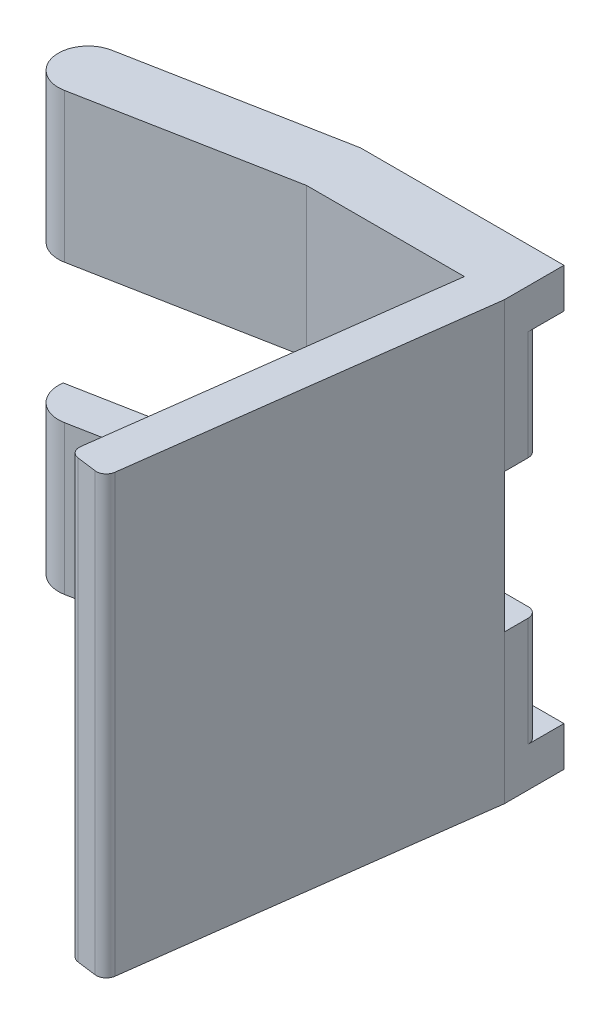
ISO-10303-21;
HEADER;
FILE_DESCRIPTION(('STEP AP214'),'2;1');
FILE_NAME('part.step','',(''),(''),'','','');
FILE_SCHEMA(('AUTOMOTIVE_DESIGN { 1 0 10303 214 1 1 1 1 }'));
ENDSEC;
DATA;
#1=APPLICATION_CONTEXT('core data for automotive mechanical design processes');
#2=APPLICATION_PROTOCOL_DEFINITION('international standard','automotive_design',2000,#1);
#3=PRODUCT_CONTEXT('',#1,'mechanical');
#4=PRODUCT('Part','Part','',(#3));
#5=PRODUCT_RELATED_PRODUCT_CATEGORY('part','',(#4));
#6=PRODUCT_DEFINITION_FORMATION('','',#4);
#7=PRODUCT_DEFINITION_CONTEXT('part definition',#1,'design');
#8=PRODUCT_DEFINITION('design','',#6,#7);
#9=PRODUCT_DEFINITION_SHAPE('','',#8);
#10=(LENGTH_UNIT() NAMED_UNIT(*) SI_UNIT(.MILLI.,.METRE.));
#11=(NAMED_UNIT(*) PLANE_ANGLE_UNIT() SI_UNIT($,.RADIAN.));
#12=(NAMED_UNIT(*) SI_UNIT($,.STERADIAN.) SOLID_ANGLE_UNIT());
#13=UNCERTAINTY_MEASURE_WITH_UNIT(LENGTH_MEASURE(1.E-05),#10,'distance_accuracy_value','');
#14=(GEOMETRIC_REPRESENTATION_CONTEXT(3) GLOBAL_UNCERTAINTY_ASSIGNED_CONTEXT((#13)) GLOBAL_UNIT_ASSIGNED_CONTEXT((#10,
#11,#12)) REPRESENTATION_CONTEXT('',''));
#15=CARTESIAN_POINT('',(0.,0.,0.));
#16=DIRECTION('',(0.,0.,1.));
#17=DIRECTION('',(1.,0.,0.));
#18=AXIS2_PLACEMENT_3D('',#15,#16,#17);
#19=CARTESIAN_POINT('',(34.5000000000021,9.,11.0000000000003));
#20=DIRECTION('',(-0.422885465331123,0.,-0.906183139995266));
#21=DIRECTION('',(-0.906183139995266,0.,0.422885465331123));
#22=AXIS2_PLACEMENT_3D('',#19,#20,#21);
#23=PLANE('',#22);
#24=DIRECTION('',(-0.906183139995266,0.,0.422885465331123));
#25=VECTOR('',#24,1.);
#26=CARTESIAN_POINT('',(34.5000000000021,9.,11.0000000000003));
#27=LINE('',#26,#25);
#28=CARTESIAN_POINT('',(33.0000000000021,9.,11.7000000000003));
#29=VERTEX_POINT('',#28);
#30=CARTESIAN_POINT('',(34.5000000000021,9.,11.0000000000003));
#31=VERTEX_POINT('',#30);
#32=EDGE_CURVE('E906',#29,#31,#27,.F.);
#33=ORIENTED_EDGE('',*,*,#32,.T.);
#34=DIRECTION('',(0.,1.,0.));
#35=VECTOR('',#34,1.);
#36=CARTESIAN_POINT('',(34.5000000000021,9.,11.0000000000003));
#37=LINE('',#36,#35);
#38=CARTESIAN_POINT('',(34.5000000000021,3.5,11.0000000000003));
#39=VERTEX_POINT('',#38);
#40=EDGE_CURVE('E878',#39,#31,#37,.T.);
#41=ORIENTED_EDGE('',*,*,#40,.F.);
#42=DIRECTION('',(-0.906183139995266,0.,0.422885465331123));
#43=VECTOR('',#42,1.);
#44=CARTESIAN_POINT('',(34.5000000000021,3.5,11.0000000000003));
#45=LINE('',#44,#43);
#46=CARTESIAN_POINT('',(33.0000000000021,3.5,11.7000000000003));
#47=VERTEX_POINT('',#46);
#48=EDGE_CURVE('E910',#39,#47,#45,.T.);
#49=ORIENTED_EDGE('',*,*,#48,.T.);
#50=DIRECTION('',(0.,1.,0.));
#51=VECTOR('',#50,1.);
#52=CARTESIAN_POINT('',(33.0000000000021,9.,11.7000000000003));
#53=LINE('',#52,#51);
#54=EDGE_CURVE('E890',#29,#47,#53,.F.);
#55=ORIENTED_EDGE('',*,*,#54,.F.);
#56=EDGE_LOOP('',(#33,#41,#49,#55));
#57=FACE_BOUND('',#56,.T.);
#58=ADVANCED_FACE('F15',(#57),#23,.T.);
#59=CARTESIAN_POINT('',(33.0000000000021,-9.,11.7000000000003));
#60=DIRECTION('',(-0.422885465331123,0.,-0.906183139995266));
#61=DIRECTION('',(-0.906183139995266,0.,0.422885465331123));
#62=AXIS2_PLACEMENT_3D('',#59,#60,#61);
#63=PLANE('',#62);
#64=DIRECTION('',(-0.906183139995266,0.,0.422885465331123));
#65=VECTOR('',#64,1.);
#66=CARTESIAN_POINT('',(33.0000000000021,-9.,11.7000000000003));
#67=LINE('',#66,#65);
#68=CARTESIAN_POINT('',(34.5000000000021,-9.,11.0000000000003));
#69=VERTEX_POINT('',#68);
#70=CARTESIAN_POINT('',(33.0000000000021,-9.,11.7000000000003));
#71=VERTEX_POINT('',#70);
#72=EDGE_CURVE('E899',#69,#71,#67,.T.);
#73=ORIENTED_EDGE('',*,*,#72,.T.);
#74=DIRECTION('',(0.,1.,0.));
#75=VECTOR('',#74,1.);
#76=CARTESIAN_POINT('',(33.0000000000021,-9.,11.7000000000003));
#77=LINE('',#76,#75);
#78=CARTESIAN_POINT('',(33.0000000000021,-3.5,11.7000000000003));
#79=VERTEX_POINT('',#78);
#80=EDGE_CURVE('E886',#79,#71,#77,.F.);
#81=ORIENTED_EDGE('',*,*,#80,.F.);
#82=DIRECTION('',(-0.906183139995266,0.,0.422885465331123));
#83=VECTOR('',#82,1.);
#84=CARTESIAN_POINT('',(33.0000000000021,-3.5,11.7000000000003));
#85=LINE('',#84,#83);
#86=CARTESIAN_POINT('',(34.5000000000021,-3.5,11.0000000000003));
#87=VERTEX_POINT('',#86);
#88=EDGE_CURVE('E903',#79,#87,#85,.F.);
#89=ORIENTED_EDGE('',*,*,#88,.T.);
#90=DIRECTION('',(0.,1.,0.));
#91=VECTOR('',#90,1.);
#92=CARTESIAN_POINT('',(34.5000000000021,-9.,11.0000000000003));
#93=LINE('',#92,#91);
#94=EDGE_CURVE('E865',#69,#87,#93,.T.);
#95=ORIENTED_EDGE('',*,*,#94,.F.);
#96=EDGE_LOOP('',(#73,#81,#89,#95));
#97=FACE_BOUND('',#96,.T.);
#98=ADVANCED_FACE('F1547',(#97),#63,.T.);
#99=CARTESIAN_POINT('',(33.0000000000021,9.,11.7000000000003));
#100=DIRECTION('',(1.,0.,0.));
#101=DIRECTION('',(0.,0.,-1.));
#102=AXIS2_PLACEMENT_3D('',#99,#100,#101);
#103=PLANE('',#102);
#104=DIRECTION('',(0.,0.,-1.));
#105=VECTOR('',#104,1.);
#106=CARTESIAN_POINT('',(33.0000000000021,9.,11.7000000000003));
#107=LINE('',#106,#105);
#108=CARTESIAN_POINT('',(33.0000000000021,9.,11.0000000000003));
#109=VERTEX_POINT('',#108);
#110=EDGE_CURVE('E893',#109,#29,#107,.F.);
#111=ORIENTED_EDGE('',*,*,#110,.T.);
#112=ORIENTED_EDGE('',*,*,#54,.T.);
#113=DIRECTION('',(0.,0.,-1.));
#114=VECTOR('',#113,1.);
#115=CARTESIAN_POINT('',(33.0000000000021,3.5,11.7000000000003));
#116=LINE('',#115,#114);
#117=CARTESIAN_POINT('',(33.0000000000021,3.5,11.0000000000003));
#118=VERTEX_POINT('',#117);
#119=EDGE_CURVE('E896',#47,#118,#116,.T.);
#120=ORIENTED_EDGE('',*,*,#119,.T.);
#121=DIRECTION('',(0.,1.,0.));
#122=VECTOR('',#121,1.);
#123=CARTESIAN_POINT('',(33.0000000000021,9.,11.0000000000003));
#124=LINE('',#123,#122);
#125=EDGE_CURVE('E856',#109,#118,#124,.F.);
#126=ORIENTED_EDGE('',*,*,#125,.F.);
#127=EDGE_LOOP('',(#111,#112,#120,#126));
#128=FACE_BOUND('',#127,.T.);
#129=ADVANCED_FACE('F1045',(#128),#103,.T.);
#130=CARTESIAN_POINT('',(33.0000000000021,-9.,11.0000000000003));
#131=DIRECTION('',(1.,0.,0.));
#132=DIRECTION('',(0.,0.,-1.));
#133=AXIS2_PLACEMENT_3D('',#130,#131,#132);
#134=PLANE('',#133);
#135=DIRECTION('',(0.,0.,-1.));
#136=VECTOR('',#135,1.);
#137=CARTESIAN_POINT('',(33.0000000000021,-9.,11.0000000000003));
#138=LINE('',#137,#136);
#139=CARTESIAN_POINT('',(33.0000000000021,-9.,11.0000000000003));
#140=VERTEX_POINT('',#139);
#141=EDGE_CURVE('E882',#71,#140,#138,.T.);
#142=ORIENTED_EDGE('',*,*,#141,.T.);
#143=DIRECTION('',(0.,1.,0.));
#144=VECTOR('',#143,1.);
#145=CARTESIAN_POINT('',(33.0000000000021,-9.,11.0000000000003));
#146=LINE('',#145,#144);
#147=CARTESIAN_POINT('',(33.0000000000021,-3.5,11.0000000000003));
#148=VERTEX_POINT('',#147);
#149=EDGE_CURVE('E852',#148,#140,#146,.F.);
#150=ORIENTED_EDGE('',*,*,#149,.F.);
#151=DIRECTION('',(0.,0.,-1.));
#152=VECTOR('',#151,1.);
#153=CARTESIAN_POINT('',(33.0000000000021,-3.5,11.0000000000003));
#154=LINE('',#153,#152);
#155=EDGE_CURVE('E887',#148,#79,#154,.F.);
#156=ORIENTED_EDGE('',*,*,#155,.T.);
#157=ORIENTED_EDGE('',*,*,#80,.T.);
#158=EDGE_LOOP('',(#142,#150,#156,#157));
#159=FACE_BOUND('',#158,.T.);
#160=ADVANCED_FACE('F1533',(#159),#134,.T.);
#161=CARTESIAN_POINT('',(34.5000000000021,9.,11.7000000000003));
#162=DIRECTION('',(1.,0.,0.));
#163=DIRECTION('',(0.,0.,-1.));
#164=AXIS2_PLACEMENT_3D('',#161,#162,#163);
#165=PLANE('',#164);
#166=DIRECTION('',(0.,0.,-1.));
#167=VECTOR('',#166,1.);
#168=CARTESIAN_POINT('',(34.5000000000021,9.,11.7000000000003));
#169=LINE('',#168,#167);
#170=CARTESIAN_POINT('',(34.5000000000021,9.,11.7000000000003));
#171=VERTEX_POINT('',#170);
#172=EDGE_CURVE('E874',#31,#171,#169,.F.);
#173=ORIENTED_EDGE('',*,*,#172,.T.);
#174=DIRECTION('',(0.,1.,0.));
#175=VECTOR('',#174,1.);
#176=CARTESIAN_POINT('',(34.5000000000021,9.,11.7000000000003));
#177=LINE('',#176,#175);
#178=CARTESIAN_POINT('',(34.5000000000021,3.5,11.7000000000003));
#179=VERTEX_POINT('',#178);
#180=EDGE_CURVE('E844',#179,#171,#177,.T.);
#181=ORIENTED_EDGE('',*,*,#180,.F.);
#182=DIRECTION('',(0.,0.,-1.));
#183=VECTOR('',#182,1.);
#184=CARTESIAN_POINT('',(34.5000000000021,3.5,11.7000000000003));
#185=LINE('',#184,#183);
#186=EDGE_CURVE('E879',#179,#39,#185,.T.);
#187=ORIENTED_EDGE('',*,*,#186,.T.);
#188=ORIENTED_EDGE('',*,*,#40,.T.);
#189=EDGE_LOOP('',(#173,#181,#187,#188));
#190=FACE_BOUND('',#189,.T.);
#191=ADVANCED_FACE('F1052',(#190),#165,.T.);
#192=CARTESIAN_POINT('',(34.5000000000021,-9.,11.0000000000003));
#193=DIRECTION('',(1.,0.,0.));
#194=DIRECTION('',(0.,0.,-1.));
#195=AXIS2_PLACEMENT_3D('',#192,#193,#194);
#196=PLANE('',#195);
#197=DIRECTION('',(0.,0.,-1.));
#198=VECTOR('',#197,1.);
#199=CARTESIAN_POINT('',(34.5000000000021,-9.,11.0000000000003));
#200=LINE('',#199,#198);
#201=CARTESIAN_POINT('',(34.5000000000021,-9.,11.7000000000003));
#202=VERTEX_POINT('',#201);
#203=EDGE_CURVE('E868',#202,#69,#200,.T.);
#204=ORIENTED_EDGE('',*,*,#203,.T.);
#205=ORIENTED_EDGE('',*,*,#94,.T.);
#206=DIRECTION('',(0.,0.,-1.));
#207=VECTOR('',#206,1.);
#208=CARTESIAN_POINT('',(34.5000000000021,-3.5,11.0000000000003));
#209=LINE('',#208,#207);
#210=CARTESIAN_POINT('',(34.5000000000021,-3.5,11.7000000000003));
#211=VERTEX_POINT('',#210);
#212=EDGE_CURVE('E871',#87,#211,#209,.F.);
#213=ORIENTED_EDGE('',*,*,#212,.T.);
#214=DIRECTION('',(0.,1.,0.));
#215=VECTOR('',#214,1.);
#216=CARTESIAN_POINT('',(34.5000000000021,-9.,11.7000000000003));
#217=LINE('',#216,#215);
#218=EDGE_CURVE('E831',#202,#211,#217,.T.);
#219=ORIENTED_EDGE('',*,*,#218,.F.);
#220=EDGE_LOOP('',(#204,#205,#213,#219));
#221=FACE_BOUND('',#220,.T.);
#222=ADVANCED_FACE('F1519',(#221),#196,.T.);
#223=CARTESIAN_POINT('',(33.0000000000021,9.,11.0000000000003));
#224=DIRECTION('',(-0.422885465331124,0.,-0.906183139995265));
#225=DIRECTION('',(-0.906183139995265,0.,0.422885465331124));
#226=AXIS2_PLACEMENT_3D('',#223,#224,#225);
#227=PLANE('',#226);
#228=DIRECTION('',(-0.906183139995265,0.,0.422885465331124));
#229=VECTOR('',#228,1.);
#230=CARTESIAN_POINT('',(33.0000000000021,9.,11.0000000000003));
#231=LINE('',#230,#229);
#232=CARTESIAN_POINT('',(31.5000000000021,9.,11.7000000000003));
#233=VERTEX_POINT('',#232);
#234=EDGE_CURVE('E859',#233,#109,#231,.F.);
#235=ORIENTED_EDGE('',*,*,#234,.T.);
#236=ORIENTED_EDGE('',*,*,#125,.T.);
#237=DIRECTION('',(-0.906183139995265,0.,0.422885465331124));
#238=VECTOR('',#237,1.);
#239=CARTESIAN_POINT('',(33.0000000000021,3.5,11.0000000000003));
#240=LINE('',#239,#238);
#241=CARTESIAN_POINT('',(31.5000000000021,3.5,11.7000000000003));
#242=VERTEX_POINT('',#241);
#243=EDGE_CURVE('E862',#118,#242,#240,.T.);
#244=ORIENTED_EDGE('',*,*,#243,.T.);
#245=DIRECTION('',(0.,1.,0.));
#246=VECTOR('',#245,1.);
#247=CARTESIAN_POINT('',(31.5000000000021,9.,11.7000000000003));
#248=LINE('',#247,#246);
#249=EDGE_CURVE('E822',#233,#242,#248,.F.);
#250=ORIENTED_EDGE('',*,*,#249,.F.);
#251=EDGE_LOOP('',(#235,#236,#244,#250));
#252=FACE_BOUND('',#251,.T.);
#253=ADVANCED_FACE('F1042',(#252),#227,.T.);
#254=CARTESIAN_POINT('',(31.5000000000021,-9.,11.7000000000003));
#255=DIRECTION('',(-0.422885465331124,0.,-0.906183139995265));
#256=DIRECTION('',(-0.906183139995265,0.,0.422885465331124));
#257=AXIS2_PLACEMENT_3D('',#254,#255,#256);
#258=PLANE('',#257);
#259=DIRECTION('',(-0.906183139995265,0.,0.422885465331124));
#260=VECTOR('',#259,1.);
#261=CARTESIAN_POINT('',(31.5000000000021,-9.,11.7000000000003));
#262=LINE('',#261,#260);
#263=CARTESIAN_POINT('',(31.5000000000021,-9.,11.7000000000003));
#264=VERTEX_POINT('',#263);
#265=EDGE_CURVE('E848',#140,#264,#262,.T.);
#266=ORIENTED_EDGE('',*,*,#265,.T.);
#267=DIRECTION('',(0.,1.,0.));
#268=VECTOR('',#267,1.);
#269=CARTESIAN_POINT('',(31.5000000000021,-9.,11.7000000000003));
#270=LINE('',#269,#268);
#271=CARTESIAN_POINT('',(31.5000000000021,-3.5,11.7000000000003));
#272=VERTEX_POINT('',#271);
#273=EDGE_CURVE('E818',#272,#264,#270,.F.);
#274=ORIENTED_EDGE('',*,*,#273,.F.);
#275=DIRECTION('',(-0.906183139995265,0.,0.422885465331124));
#276=VECTOR('',#275,1.);
#277=CARTESIAN_POINT('',(31.5000000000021,-3.5,11.7000000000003));
#278=LINE('',#277,#276);
#279=EDGE_CURVE('E853',#272,#148,#278,.F.);
#280=ORIENTED_EDGE('',*,*,#279,.T.);
#281=ORIENTED_EDGE('',*,*,#149,.T.);
#282=EDGE_LOOP('',(#266,#274,#280,#281));
#283=FACE_BOUND('',#282,.T.);
#284=ADVANCED_FACE('F1505',(#283),#258,.T.);
#285=CARTESIAN_POINT('',(36.0000000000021,9.,11.0000000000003));
#286=DIRECTION('',(-0.422885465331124,0.,-0.906183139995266));
#287=DIRECTION('',(-0.906183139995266,0.,0.422885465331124));
#288=AXIS2_PLACEMENT_3D('',#285,#286,#287);
#289=PLANE('',#288);
#290=DIRECTION('',(-0.906183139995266,0.,0.422885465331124));
#291=VECTOR('',#290,1.);
#292=CARTESIAN_POINT('',(36.0000000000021,9.,11.0000000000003));
#293=LINE('',#292,#291);
#294=CARTESIAN_POINT('',(36.0000000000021,9.,11.0000000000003));
#295=VERTEX_POINT('',#294);
#296=EDGE_CURVE('E840',#171,#295,#293,.F.);
#297=ORIENTED_EDGE('',*,*,#296,.T.);
#298=DIRECTION('',(0.,1.,0.));
#299=VECTOR('',#298,1.);
#300=CARTESIAN_POINT('',(36.0000000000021,9.,11.0000000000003));
#301=LINE('',#300,#299);
#302=CARTESIAN_POINT('',(36.0000000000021,3.5,11.0000000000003));
#303=VERTEX_POINT('',#302);
#304=EDGE_CURVE('E810',#303,#295,#301,.T.);
#305=ORIENTED_EDGE('',*,*,#304,.F.);
#306=DIRECTION('',(-0.906183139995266,0.,0.422885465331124));
#307=VECTOR('',#306,1.);
#308=CARTESIAN_POINT('',(36.0000000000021,3.5,11.0000000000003));
#309=LINE('',#308,#307);
#310=EDGE_CURVE('E845',#303,#179,#309,.T.);
#311=ORIENTED_EDGE('',*,*,#310,.T.);
#312=ORIENTED_EDGE('',*,*,#180,.T.);
#313=EDGE_LOOP('',(#297,#305,#311,#312));
#314=FACE_BOUND('',#313,.T.);
#315=ADVANCED_FACE('F1056',(#314),#289,.T.);
#316=CARTESIAN_POINT('',(34.5000000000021,-9.,11.7000000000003));
#317=DIRECTION('',(-0.422885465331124,0.,-0.906183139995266));
#318=DIRECTION('',(-0.906183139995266,0.,0.422885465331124));
#319=AXIS2_PLACEMENT_3D('',#316,#317,#318);
#320=PLANE('',#319);
#321=DIRECTION('',(-0.906183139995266,0.,0.422885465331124));
#322=VECTOR('',#321,1.);
#323=CARTESIAN_POINT('',(34.5000000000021,-9.,11.7000000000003));
#324=LINE('',#323,#322);
#325=CARTESIAN_POINT('',(36.0000000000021,-9.,11.0000000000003));
#326=VERTEX_POINT('',#325);
#327=EDGE_CURVE('E834',#326,#202,#324,.T.);
#328=ORIENTED_EDGE('',*,*,#327,.T.);
#329=ORIENTED_EDGE('',*,*,#218,.T.);
#330=DIRECTION('',(-0.906183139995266,0.,0.422885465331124));
#331=VECTOR('',#330,1.);
#332=CARTESIAN_POINT('',(34.5000000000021,-3.5,11.7000000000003));
#333=LINE('',#332,#331);
#334=CARTESIAN_POINT('',(36.0000000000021,-3.5,11.0000000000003));
#335=VERTEX_POINT('',#334);
#336=EDGE_CURVE('E837',#211,#335,#333,.F.);
#337=ORIENTED_EDGE('',*,*,#336,.T.);
#338=DIRECTION('',(0.,1.,0.));
#339=VECTOR('',#338,1.);
#340=CARTESIAN_POINT('',(36.0000000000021,-9.,11.0000000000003));
#341=LINE('',#340,#339);
#342=EDGE_CURVE('E797',#326,#335,#341,.T.);
#343=ORIENTED_EDGE('',*,*,#342,.F.);
#344=EDGE_LOOP('',(#328,#329,#337,#343));
#345=FACE_BOUND('',#344,.T.);
#346=ADVANCED_FACE('F1491',(#345),#320,.T.);
#347=CARTESIAN_POINT('',(31.5000000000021,9.,11.7000000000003));
#348=DIRECTION('',(1.,0.,0.));
#349=DIRECTION('',(0.,0.,-1.));
#350=AXIS2_PLACEMENT_3D('',#347,#348,#349);
#351=PLANE('',#350);
#352=DIRECTION('',(0.,0.,-1.));
#353=VECTOR('',#352,1.);
#354=CARTESIAN_POINT('',(31.5000000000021,9.,11.7000000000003));
#355=LINE('',#354,#353);
#356=CARTESIAN_POINT('',(31.5000000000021,9.,11.0000000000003));
#357=VERTEX_POINT('',#356);
#358=EDGE_CURVE('E825',#357,#233,#355,.F.);
#359=ORIENTED_EDGE('',*,*,#358,.T.);
#360=ORIENTED_EDGE('',*,*,#249,.T.);
#361=DIRECTION('',(0.,0.,-1.));
#362=VECTOR('',#361,1.);
#363=CARTESIAN_POINT('',(31.5000000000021,3.5,11.7000000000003));
#364=LINE('',#363,#362);
#365=CARTESIAN_POINT('',(31.5000000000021,3.5,11.0000000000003));
#366=VERTEX_POINT('',#365);
#367=EDGE_CURVE('E828',#242,#366,#364,.T.);
#368=ORIENTED_EDGE('',*,*,#367,.T.);
#369=DIRECTION('',(0.,1.,0.));
#370=VECTOR('',#369,1.);
#371=CARTESIAN_POINT('',(31.5000000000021,9.,11.0000000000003));
#372=LINE('',#371,#370);
#373=EDGE_CURVE('E788',#357,#366,#372,.F.);
#374=ORIENTED_EDGE('',*,*,#373,.F.);
#375=EDGE_LOOP('',(#359,#360,#368,#374));
#376=FACE_BOUND('',#375,.T.);
#377=ADVANCED_FACE('F1039',(#376),#351,.T.);
#378=CARTESIAN_POINT('',(31.5000000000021,-9.,11.0000000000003));
#379=DIRECTION('',(1.,0.,0.));
#380=DIRECTION('',(0.,0.,-1.));
#381=AXIS2_PLACEMENT_3D('',#378,#379,#380);
#382=PLANE('',#381);
#383=DIRECTION('',(0.,0.,-1.));
#384=VECTOR('',#383,1.);
#385=CARTESIAN_POINT('',(31.5000000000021,-9.,11.0000000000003));
#386=LINE('',#385,#384);
#387=CARTESIAN_POINT('',(31.5000000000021,-9.,11.0000000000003));
#388=VERTEX_POINT('',#387);
#389=EDGE_CURVE('E814',#264,#388,#386,.T.);
#390=ORIENTED_EDGE('',*,*,#389,.T.);
#391=DIRECTION('',(0.,1.,0.));
#392=VECTOR('',#391,1.);
#393=CARTESIAN_POINT('',(31.5000000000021,-9.,11.0000000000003));
#394=LINE('',#393,#392);
#395=CARTESIAN_POINT('',(31.5000000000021,-3.5,11.0000000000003));
#396=VERTEX_POINT('',#395);
#397=EDGE_CURVE('E784',#396,#388,#394,.F.);
#398=ORIENTED_EDGE('',*,*,#397,.F.);
#399=DIRECTION('',(0.,0.,-1.));
#400=VECTOR('',#399,1.);
#401=CARTESIAN_POINT('',(31.5000000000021,-3.5,11.0000000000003));
#402=LINE('',#401,#400);
#403=EDGE_CURVE('E819',#396,#272,#402,.F.);
#404=ORIENTED_EDGE('',*,*,#403,.T.);
#405=ORIENTED_EDGE('',*,*,#273,.T.);
#406=EDGE_LOOP('',(#390,#398,#404,#405));
#407=FACE_BOUND('',#406,.T.);
#408=ADVANCED_FACE('F1477',(#407),#382,.T.);
#409=CARTESIAN_POINT('',(36.0000000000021,9.,11.7000000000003));
#410=DIRECTION('',(1.,0.,0.));
#411=DIRECTION('',(0.,0.,-1.));
#412=AXIS2_PLACEMENT_3D('',#409,#410,#411);
#413=PLANE('',#412);
#414=DIRECTION('',(0.,0.,-1.));
#415=VECTOR('',#414,1.);
#416=CARTESIAN_POINT('',(36.0000000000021,9.,11.7000000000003));
#417=LINE('',#416,#415);
#418=CARTESIAN_POINT('',(36.0000000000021,9.,11.7000000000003));
#419=VERTEX_POINT('',#418);
#420=EDGE_CURVE('E806',#295,#419,#417,.F.);
#421=ORIENTED_EDGE('',*,*,#420,.T.);
#422=DIRECTION('',(0.,1.,0.));
#423=VECTOR('',#422,1.);
#424=CARTESIAN_POINT('',(36.0000000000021,9.,11.7000000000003));
#425=LINE('',#424,#423);
#426=CARTESIAN_POINT('',(36.0000000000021,3.5,11.7000000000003));
#427=VERTEX_POINT('',#426);
#428=EDGE_CURVE('E776',#427,#419,#425,.T.);
#429=ORIENTED_EDGE('',*,*,#428,.F.);
#430=DIRECTION('',(0.,0.,-1.));
#431=VECTOR('',#430,1.);
#432=CARTESIAN_POINT('',(36.0000000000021,3.5,11.7000000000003));
#433=LINE('',#432,#431);
#434=EDGE_CURVE('E811',#427,#303,#433,.T.);
#435=ORIENTED_EDGE('',*,*,#434,.T.);
#436=ORIENTED_EDGE('',*,*,#304,.T.);
#437=EDGE_LOOP('',(#421,#429,#435,#436));
#438=FACE_BOUND('',#437,.T.);
#439=ADVANCED_FACE('F1060',(#438),#413,.T.);
#440=CARTESIAN_POINT('',(36.0000000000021,-9.,11.0000000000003));
#441=DIRECTION('',(1.,0.,0.));
#442=DIRECTION('',(0.,0.,-1.));
#443=AXIS2_PLACEMENT_3D('',#440,#441,#442);
#444=PLANE('',#443);
#445=DIRECTION('',(0.,0.,-1.));
#446=VECTOR('',#445,1.);
#447=CARTESIAN_POINT('',(36.0000000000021,-9.,11.0000000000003));
#448=LINE('',#447,#446);
#449=CARTESIAN_POINT('',(36.0000000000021,-9.,11.7000000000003));
#450=VERTEX_POINT('',#449);
#451=EDGE_CURVE('E800',#450,#326,#448,.T.);
#452=ORIENTED_EDGE('',*,*,#451,.T.);
#453=ORIENTED_EDGE('',*,*,#342,.T.);
#454=DIRECTION('',(0.,0.,-1.));
#455=VECTOR('',#454,1.);
#456=CARTESIAN_POINT('',(36.0000000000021,-3.5,11.0000000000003));
#457=LINE('',#456,#455);
#458=CARTESIAN_POINT('',(36.0000000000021,-3.5,11.7000000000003));
#459=VERTEX_POINT('',#458);
#460=EDGE_CURVE('E803',#335,#459,#457,.F.);
#461=ORIENTED_EDGE('',*,*,#460,.T.);
#462=DIRECTION('',(0.,1.,0.));
#463=VECTOR('',#462,1.);
#464=CARTESIAN_POINT('',(36.0000000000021,-9.,11.7000000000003));
#465=LINE('',#464,#463);
#466=EDGE_CURVE('E763',#450,#459,#465,.T.);
#467=ORIENTED_EDGE('',*,*,#466,.F.);
#468=EDGE_LOOP('',(#452,#453,#461,#467));
#469=FACE_BOUND('',#468,.T.);
#470=ADVANCED_FACE('F1463',(#469),#444,.T.);
#471=CARTESIAN_POINT('',(31.5000000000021,9.,11.0000000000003));
#472=DIRECTION('',(-0.422885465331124,0.,-0.906183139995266));
#473=DIRECTION('',(-0.906183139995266,0.,0.422885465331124));
#474=AXIS2_PLACEMENT_3D('',#471,#472,#473);
#475=PLANE('',#474);
#476=DIRECTION('',(-0.906183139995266,0.,0.422885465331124));
#477=VECTOR('',#476,1.);
#478=CARTESIAN_POINT('',(31.5000000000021,9.,11.0000000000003));
#479=LINE('',#478,#477);
#480=CARTESIAN_POINT('',(30.0000000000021,9.,11.7000000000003));
#481=VERTEX_POINT('',#480);
#482=EDGE_CURVE('E791',#481,#357,#479,.F.);
#483=ORIENTED_EDGE('',*,*,#482,.T.);
#484=ORIENTED_EDGE('',*,*,#373,.T.);
#485=DIRECTION('',(-0.906183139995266,0.,0.422885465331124));
#486=VECTOR('',#485,1.);
#487=CARTESIAN_POINT('',(31.5000000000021,3.5,11.0000000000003));
#488=LINE('',#487,#486);
#489=CARTESIAN_POINT('',(30.0000000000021,3.5,11.7000000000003));
#490=VERTEX_POINT('',#489);
#491=EDGE_CURVE('E794',#366,#490,#488,.T.);
#492=ORIENTED_EDGE('',*,*,#491,.T.);
#493=DIRECTION('',(0.,1.,0.));
#494=VECTOR('',#493,1.);
#495=CARTESIAN_POINT('',(30.0000000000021,9.,11.7000000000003));
#496=LINE('',#495,#494);
#497=EDGE_CURVE('E754',#481,#490,#496,.F.);
#498=ORIENTED_EDGE('',*,*,#497,.F.);
#499=EDGE_LOOP('',(#483,#484,#492,#498));
#500=FACE_BOUND('',#499,.T.);
#501=ADVANCED_FACE('F1036',(#500),#475,.T.);
#502=CARTESIAN_POINT('',(30.0000000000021,-9.,11.7000000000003));
#503=DIRECTION('',(-0.422885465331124,0.,-0.906183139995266));
#504=DIRECTION('',(-0.906183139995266,0.,0.422885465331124));
#505=AXIS2_PLACEMENT_3D('',#502,#503,#504);
#506=PLANE('',#505);
#507=DIRECTION('',(-0.906183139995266,0.,0.422885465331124));
#508=VECTOR('',#507,1.);
#509=CARTESIAN_POINT('',(30.0000000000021,-9.,11.7000000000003));
#510=LINE('',#509,#508);
#511=CARTESIAN_POINT('',(30.0000000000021,-9.,11.7000000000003));
#512=VERTEX_POINT('',#511);
#513=EDGE_CURVE('E780',#388,#512,#510,.T.);
#514=ORIENTED_EDGE('',*,*,#513,.T.);
#515=DIRECTION('',(0.,1.,0.));
#516=VECTOR('',#515,1.);
#517=CARTESIAN_POINT('',(30.0000000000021,-9.,11.7000000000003));
#518=LINE('',#517,#516);
#519=CARTESIAN_POINT('',(30.0000000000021,-3.5,11.7000000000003));
#520=VERTEX_POINT('',#519);
#521=EDGE_CURVE('E750',#520,#512,#518,.F.);
#522=ORIENTED_EDGE('',*,*,#521,.F.);
#523=DIRECTION('',(-0.906183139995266,0.,0.422885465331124));
#524=VECTOR('',#523,1.);
#525=CARTESIAN_POINT('',(30.0000000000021,-3.5,11.7000000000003));
#526=LINE('',#525,#524);
#527=EDGE_CURVE('E785',#520,#396,#526,.F.);
#528=ORIENTED_EDGE('',*,*,#527,.T.);
#529=ORIENTED_EDGE('',*,*,#397,.T.);
#530=EDGE_LOOP('',(#514,#522,#528,#529));
#531=FACE_BOUND('',#530,.T.);
#532=ADVANCED_FACE('F1449',(#531),#506,.T.);
#533=CARTESIAN_POINT('',(37.5000000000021,9.,11.0000000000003));
#534=DIRECTION('',(-0.422885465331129,0.,-0.906183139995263));
#535=DIRECTION('',(-0.906183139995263,0.,0.422885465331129));
#536=AXIS2_PLACEMENT_3D('',#533,#534,#535);
#537=PLANE('',#536);
#538=DIRECTION('',(-0.906183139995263,0.,0.422885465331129));
#539=VECTOR('',#538,1.);
#540=CARTESIAN_POINT('',(37.5000000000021,9.,11.0000000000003));
#541=LINE('',#540,#539);
#542=CARTESIAN_POINT('',(37.5000000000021,9.,11.0000000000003));
#543=VERTEX_POINT('',#542);
#544=EDGE_CURVE('E772',#419,#543,#541,.F.);
#545=ORIENTED_EDGE('',*,*,#544,.T.);
#546=DIRECTION('',(0.,1.,0.));
#547=VECTOR('',#546,1.);
#548=CARTESIAN_POINT('',(37.5000000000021,9.,11.0000000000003));
#549=LINE('',#548,#547);
#550=CARTESIAN_POINT('',(37.5000000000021,3.5,11.0000000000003));
#551=VERTEX_POINT('',#550);
#552=EDGE_CURVE('E742',#551,#543,#549,.T.);
#553=ORIENTED_EDGE('',*,*,#552,.F.);
#554=DIRECTION('',(-0.906183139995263,0.,0.422885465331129));
#555=VECTOR('',#554,1.);
#556=CARTESIAN_POINT('',(37.5000000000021,3.5,11.0000000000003));
#557=LINE('',#556,#555);
#558=EDGE_CURVE('E777',#551,#427,#557,.T.);
#559=ORIENTED_EDGE('',*,*,#558,.T.);
#560=ORIENTED_EDGE('',*,*,#428,.T.);
#561=EDGE_LOOP('',(#545,#553,#559,#560));
#562=FACE_BOUND('',#561,.T.);
#563=ADVANCED_FACE('F1064',(#562),#537,.T.);
#564=CARTESIAN_POINT('',(36.0000000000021,-9.,11.7000000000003));
#565=DIRECTION('',(-0.422885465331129,0.,-0.906183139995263));
#566=DIRECTION('',(-0.906183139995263,0.,0.422885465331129));
#567=AXIS2_PLACEMENT_3D('',#564,#565,#566);
#568=PLANE('',#567);
#569=DIRECTION('',(-0.906183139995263,0.,0.422885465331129));
#570=VECTOR('',#569,1.);
#571=CARTESIAN_POINT('',(36.0000000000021,-9.,11.7000000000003));
#572=LINE('',#571,#570);
#573=CARTESIAN_POINT('',(37.5000000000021,-9.,11.0000000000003));
#574=VERTEX_POINT('',#573);
#575=EDGE_CURVE('E766',#574,#450,#572,.T.);
#576=ORIENTED_EDGE('',*,*,#575,.T.);
#577=ORIENTED_EDGE('',*,*,#466,.T.);
#578=DIRECTION('',(-0.906183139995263,0.,0.422885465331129));
#579=VECTOR('',#578,1.);
#580=CARTESIAN_POINT('',(36.0000000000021,-3.5,11.7000000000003));
#581=LINE('',#580,#579);
#582=CARTESIAN_POINT('',(37.5000000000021,-3.5,11.0000000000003));
#583=VERTEX_POINT('',#582);
#584=EDGE_CURVE('E769',#459,#583,#581,.F.);
#585=ORIENTED_EDGE('',*,*,#584,.T.);
#586=DIRECTION('',(0.,1.,0.));
#587=VECTOR('',#586,1.);
#588=CARTESIAN_POINT('',(37.5000000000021,-9.,11.0000000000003));
#589=LINE('',#588,#587);
#590=EDGE_CURVE('E729',#574,#583,#589,.T.);
#591=ORIENTED_EDGE('',*,*,#590,.F.);
#592=EDGE_LOOP('',(#576,#577,#585,#591));
#593=FACE_BOUND('',#592,.T.);
#594=ADVANCED_FACE('F1435',(#593),#568,.T.);
#595=CARTESIAN_POINT('',(30.0000000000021,9.,11.7000000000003));
#596=DIRECTION('',(1.,0.,0.));
#597=DIRECTION('',(0.,0.,-1.));
#598=AXIS2_PLACEMENT_3D('',#595,#596,#597);
#599=PLANE('',#598);
#600=DIRECTION('',(0.,0.,-1.));
#601=VECTOR('',#600,1.);
#602=CARTESIAN_POINT('',(30.0000000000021,9.,11.7000000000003));
#603=LINE('',#602,#601);
#604=CARTESIAN_POINT('',(30.0000000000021,9.,11.0000000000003));
#605=VERTEX_POINT('',#604);
#606=EDGE_CURVE('E757',#605,#481,#603,.F.);
#607=ORIENTED_EDGE('',*,*,#606,.T.);
#608=ORIENTED_EDGE('',*,*,#497,.T.);
#609=DIRECTION('',(0.,0.,-1.));
#610=VECTOR('',#609,1.);
#611=CARTESIAN_POINT('',(30.0000000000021,3.5,11.7000000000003));
#612=LINE('',#611,#610);
#613=CARTESIAN_POINT('',(30.0000000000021,3.5,11.0000000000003));
#614=VERTEX_POINT('',#613);
#615=EDGE_CURVE('E760',#490,#614,#612,.T.);
#616=ORIENTED_EDGE('',*,*,#615,.T.);
#617=DIRECTION('',(0.,1.,0.));
#618=VECTOR('',#617,1.);
#619=CARTESIAN_POINT('',(30.0000000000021,9.,11.0000000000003));
#620=LINE('',#619,#618);
#621=EDGE_CURVE('E720',#605,#614,#620,.F.);
#622=ORIENTED_EDGE('',*,*,#621,.F.);
#623=EDGE_LOOP('',(#607,#608,#616,#622));
#624=FACE_BOUND('',#623,.T.);
#625=ADVANCED_FACE('F1033',(#624),#599,.T.);
#626=CARTESIAN_POINT('',(30.0000000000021,-9.,11.0000000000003));
#627=DIRECTION('',(1.,0.,0.));
#628=DIRECTION('',(0.,0.,-1.));
#629=AXIS2_PLACEMENT_3D('',#626,#627,#628);
#630=PLANE('',#629);
#631=DIRECTION('',(0.,0.,-1.));
#632=VECTOR('',#631,1.);
#633=CARTESIAN_POINT('',(30.0000000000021,-9.,11.0000000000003));
#634=LINE('',#633,#632);
#635=CARTESIAN_POINT('',(30.0000000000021,-9.,11.0000000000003));
#636=VERTEX_POINT('',#635);
#637=EDGE_CURVE('E746',#512,#636,#634,.T.);
#638=ORIENTED_EDGE('',*,*,#637,.T.);
#639=DIRECTION('',(0.,1.,0.));
#640=VECTOR('',#639,1.);
#641=CARTESIAN_POINT('',(30.0000000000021,-9.,11.0000000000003));
#642=LINE('',#641,#640);
#643=CARTESIAN_POINT('',(30.0000000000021,-3.5,11.0000000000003));
#644=VERTEX_POINT('',#643);
#645=EDGE_CURVE('E716',#644,#636,#642,.F.);
#646=ORIENTED_EDGE('',*,*,#645,.F.);
#647=DIRECTION('',(0.,0.,-1.));
#648=VECTOR('',#647,1.);
#649=CARTESIAN_POINT('',(30.0000000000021,-3.5,11.0000000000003));
#650=LINE('',#649,#648);
#651=EDGE_CURVE('E751',#644,#520,#650,.F.);
#652=ORIENTED_EDGE('',*,*,#651,.T.);
#653=ORIENTED_EDGE('',*,*,#521,.T.);
#654=EDGE_LOOP('',(#638,#646,#652,#653));
#655=FACE_BOUND('',#654,.T.);
#656=ADVANCED_FACE('F1421',(#655),#630,.T.);
#657=CARTESIAN_POINT('',(37.5000000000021,9.,11.7000000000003));
#658=DIRECTION('',(1.,0.,0.));
#659=DIRECTION('',(0.,0.,-1.));
#660=AXIS2_PLACEMENT_3D('',#657,#658,#659);
#661=PLANE('',#660);
#662=DIRECTION('',(0.,0.,-1.));
#663=VECTOR('',#662,1.);
#664=CARTESIAN_POINT('',(37.5000000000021,9.,11.7000000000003));
#665=LINE('',#664,#663);
#666=CARTESIAN_POINT('',(37.5000000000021,9.,11.7000000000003));
#667=VERTEX_POINT('',#666);
#668=EDGE_CURVE('E738',#543,#667,#665,.F.);
#669=ORIENTED_EDGE('',*,*,#668,.T.);
#670=DIRECTION('',(0.,1.,0.));
#671=VECTOR('',#670,1.);
#672=CARTESIAN_POINT('',(37.5000000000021,9.,11.7000000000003));
#673=LINE('',#672,#671);
#674=CARTESIAN_POINT('',(37.5000000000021,3.5,11.7000000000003));
#675=VERTEX_POINT('',#674);
#676=EDGE_CURVE('E708',#675,#667,#673,.T.);
#677=ORIENTED_EDGE('',*,*,#676,.F.);
#678=DIRECTION('',(0.,0.,-1.));
#679=VECTOR('',#678,1.);
#680=CARTESIAN_POINT('',(37.5000000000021,3.5,11.7000000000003));
#681=LINE('',#680,#679);
#682=EDGE_CURVE('E743',#675,#551,#681,.T.);
#683=ORIENTED_EDGE('',*,*,#682,.T.);
#684=ORIENTED_EDGE('',*,*,#552,.T.);
#685=EDGE_LOOP('',(#669,#677,#683,#684));
#686=FACE_BOUND('',#685,.T.);
#687=ADVANCED_FACE('F1068',(#686),#661,.T.);
#688=CARTESIAN_POINT('',(37.5000000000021,-9.,11.0000000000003));
#689=DIRECTION('',(1.,0.,0.));
#690=DIRECTION('',(0.,0.,-1.));
#691=AXIS2_PLACEMENT_3D('',#688,#689,#690);
#692=PLANE('',#691);
#693=DIRECTION('',(0.,0.,-1.));
#694=VECTOR('',#693,1.);
#695=CARTESIAN_POINT('',(37.5000000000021,-9.,11.0000000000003));
#696=LINE('',#695,#694);
#697=CARTESIAN_POINT('',(37.5000000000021,-9.,11.7000000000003));
#698=VERTEX_POINT('',#697);
#699=EDGE_CURVE('E732',#698,#574,#696,.T.);
#700=ORIENTED_EDGE('',*,*,#699,.T.);
#701=ORIENTED_EDGE('',*,*,#590,.T.);
#702=DIRECTION('',(0.,0.,-1.));
#703=VECTOR('',#702,1.);
#704=CARTESIAN_POINT('',(37.5000000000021,-3.5,11.0000000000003));
#705=LINE('',#704,#703);
#706=CARTESIAN_POINT('',(37.5000000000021,-3.5,11.7000000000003));
#707=VERTEX_POINT('',#706);
#708=EDGE_CURVE('E735',#583,#707,#705,.F.);
#709=ORIENTED_EDGE('',*,*,#708,.T.);
#710=DIRECTION('',(0.,1.,0.));
#711=VECTOR('',#710,1.);
#712=CARTESIAN_POINT('',(37.5000000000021,-9.,11.7000000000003));
#713=LINE('',#712,#711);
#714=EDGE_CURVE('E695',#698,#707,#713,.T.);
#715=ORIENTED_EDGE('',*,*,#714,.F.);
#716=EDGE_LOOP('',(#700,#701,#709,#715));
#717=FACE_BOUND('',#716,.T.);
#718=ADVANCED_FACE('F1407',(#717),#692,.T.);
#719=CARTESIAN_POINT('',(30.0000000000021,9.,11.0000000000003));
#720=DIRECTION('',(-0.422885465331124,0.,-0.906183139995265));
#721=DIRECTION('',(-0.906183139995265,0.,0.422885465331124));
#722=AXIS2_PLACEMENT_3D('',#719,#720,#721);
#723=PLANE('',#722);
#724=DIRECTION('',(-0.906183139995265,0.,0.422885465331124));
#725=VECTOR('',#724,1.);
#726=CARTESIAN_POINT('',(30.0000000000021,9.,11.0000000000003));
#727=LINE('',#726,#725);
#728=CARTESIAN_POINT('',(28.5000000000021,9.,11.7000000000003));
#729=VERTEX_POINT('',#728);
#730=EDGE_CURVE('E723',#729,#605,#727,.F.);
#731=ORIENTED_EDGE('',*,*,#730,.T.);
#732=ORIENTED_EDGE('',*,*,#621,.T.);
#733=DIRECTION('',(-0.906183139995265,0.,0.422885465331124));
#734=VECTOR('',#733,1.);
#735=CARTESIAN_POINT('',(30.0000000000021,3.5,11.0000000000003));
#736=LINE('',#735,#734);
#737=CARTESIAN_POINT('',(28.5000000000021,3.5,11.7000000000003));
#738=VERTEX_POINT('',#737);
#739=EDGE_CURVE('E726',#614,#738,#736,.T.);
#740=ORIENTED_EDGE('',*,*,#739,.T.);
#741=DIRECTION('',(0.,1.,0.));
#742=VECTOR('',#741,1.);
#743=CARTESIAN_POINT('',(28.5000000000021,9.,11.7000000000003));
#744=LINE('',#743,#742);
#745=EDGE_CURVE('E686',#729,#738,#744,.F.);
#746=ORIENTED_EDGE('',*,*,#745,.F.);
#747=EDGE_LOOP('',(#731,#732,#740,#746));
#748=FACE_BOUND('',#747,.T.);
#749=ADVANCED_FACE('F1030',(#748),#723,.T.);
#750=CARTESIAN_POINT('',(28.5000000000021,-9.,11.7000000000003));
#751=DIRECTION('',(-0.422885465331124,0.,-0.906183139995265));
#752=DIRECTION('',(-0.906183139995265,0.,0.422885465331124));
#753=AXIS2_PLACEMENT_3D('',#750,#751,#752);
#754=PLANE('',#753);
#755=DIRECTION('',(-0.906183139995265,0.,0.422885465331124));
#756=VECTOR('',#755,1.);
#757=CARTESIAN_POINT('',(28.5000000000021,-9.,11.7000000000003));
#758=LINE('',#757,#756);
#759=CARTESIAN_POINT('',(28.5000000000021,-9.,11.7000000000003));
#760=VERTEX_POINT('',#759);
#761=EDGE_CURVE('E712',#636,#760,#758,.T.);
#762=ORIENTED_EDGE('',*,*,#761,.T.);
#763=DIRECTION('',(0.,1.,0.));
#764=VECTOR('',#763,1.);
#765=CARTESIAN_POINT('',(28.5000000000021,-9.,11.7000000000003));
#766=LINE('',#765,#764);
#767=CARTESIAN_POINT('',(28.5000000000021,-3.5,11.7000000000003));
#768=VERTEX_POINT('',#767);
#769=EDGE_CURVE('E682',#768,#760,#766,.F.);
#770=ORIENTED_EDGE('',*,*,#769,.F.);
#771=DIRECTION('',(-0.906183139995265,0.,0.422885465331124));
#772=VECTOR('',#771,1.);
#773=CARTESIAN_POINT('',(28.5000000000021,-3.5,11.7000000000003));
#774=LINE('',#773,#772);
#775=EDGE_CURVE('E717',#768,#644,#774,.F.);
#776=ORIENTED_EDGE('',*,*,#775,.T.);
#777=ORIENTED_EDGE('',*,*,#645,.T.);
#778=EDGE_LOOP('',(#762,#770,#776,#777));
#779=FACE_BOUND('',#778,.T.);
#780=ADVANCED_FACE('F1393',(#779),#754,.T.);
#781=CARTESIAN_POINT('',(39.0000000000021,9.,11.0000000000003));
#782=DIRECTION('',(-0.422885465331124,0.,-0.906183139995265));
#783=DIRECTION('',(-0.906183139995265,0.,0.422885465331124));
#784=AXIS2_PLACEMENT_3D('',#781,#782,#783);
#785=PLANE('',#784);
#786=DIRECTION('',(-0.906183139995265,0.,0.422885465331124));
#787=VECTOR('',#786,1.);
#788=CARTESIAN_POINT('',(39.0000000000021,9.,11.0000000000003));
#789=LINE('',#788,#787);
#790=CARTESIAN_POINT('',(39.0000000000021,9.,11.0000000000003));
#791=VERTEX_POINT('',#790);
#792=EDGE_CURVE('E704',#667,#791,#789,.F.);
#793=ORIENTED_EDGE('',*,*,#792,.T.);
#794=DIRECTION('',(0.,1.,0.));
#795=VECTOR('',#794,1.);
#796=CARTESIAN_POINT('',(39.0000000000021,9.,11.0000000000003));
#797=LINE('',#796,#795);
#798=CARTESIAN_POINT('',(39.0000000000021,3.5,11.0000000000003));
#799=VERTEX_POINT('',#798);
#800=EDGE_CURVE('E674',#799,#791,#797,.T.);
#801=ORIENTED_EDGE('',*,*,#800,.F.);
#802=DIRECTION('',(-0.906183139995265,0.,0.422885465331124));
#803=VECTOR('',#802,1.);
#804=CARTESIAN_POINT('',(39.0000000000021,3.5,11.0000000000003));
#805=LINE('',#804,#803);
#806=EDGE_CURVE('E709',#799,#675,#805,.T.);
#807=ORIENTED_EDGE('',*,*,#806,.T.);
#808=ORIENTED_EDGE('',*,*,#676,.T.);
#809=EDGE_LOOP('',(#793,#801,#807,#808));
#810=FACE_BOUND('',#809,.T.);
#811=ADVANCED_FACE('F1072',(#810),#785,.T.);
#812=CARTESIAN_POINT('',(37.5000000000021,-9.,11.7000000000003));
#813=DIRECTION('',(-0.422885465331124,0.,-0.906183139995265));
#814=DIRECTION('',(-0.906183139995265,0.,0.422885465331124));
#815=AXIS2_PLACEMENT_3D('',#812,#813,#814);
#816=PLANE('',#815);
#817=DIRECTION('',(-0.906183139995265,0.,0.422885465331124));
#818=VECTOR('',#817,1.);
#819=CARTESIAN_POINT('',(37.5000000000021,-9.,11.7000000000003));
#820=LINE('',#819,#818);
#821=CARTESIAN_POINT('',(39.0000000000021,-9.,11.0000000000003));
#822=VERTEX_POINT('',#821);
#823=EDGE_CURVE('E698',#822,#698,#820,.T.);
#824=ORIENTED_EDGE('',*,*,#823,.T.);
#825=ORIENTED_EDGE('',*,*,#714,.T.);
#826=DIRECTION('',(-0.906183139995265,0.,0.422885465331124));
#827=VECTOR('',#826,1.);
#828=CARTESIAN_POINT('',(37.5000000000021,-3.5,11.7000000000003));
#829=LINE('',#828,#827);
#830=CARTESIAN_POINT('',(39.0000000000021,-3.5,11.0000000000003));
#831=VERTEX_POINT('',#830);
#832=EDGE_CURVE('E701',#707,#831,#829,.F.);
#833=ORIENTED_EDGE('',*,*,#832,.T.);
#834=DIRECTION('',(0.,1.,0.));
#835=VECTOR('',#834,1.);
#836=CARTESIAN_POINT('',(39.0000000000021,-9.,11.0000000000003));
#837=LINE('',#836,#835);
#838=EDGE_CURVE('E661',#822,#831,#837,.T.);
#839=ORIENTED_EDGE('',*,*,#838,.F.);
#840=EDGE_LOOP('',(#824,#825,#833,#839));
#841=FACE_BOUND('',#840,.T.);
#842=ADVANCED_FACE('F1379',(#841),#816,.T.);
#843=CARTESIAN_POINT('',(28.5000000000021,9.,11.7000000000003));
#844=DIRECTION('',(1.,0.,0.));
#845=DIRECTION('',(0.,0.,-1.));
#846=AXIS2_PLACEMENT_3D('',#843,#844,#845);
#847=PLANE('',#846);
#848=DIRECTION('',(0.,0.,-1.));
#849=VECTOR('',#848,1.);
#850=CARTESIAN_POINT('',(28.5000000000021,9.,11.7000000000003));
#851=LINE('',#850,#849);
#852=CARTESIAN_POINT('',(28.5000000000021,9.,11.0000000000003));
#853=VERTEX_POINT('',#852);
#854=EDGE_CURVE('E689',#853,#729,#851,.F.);
#855=ORIENTED_EDGE('',*,*,#854,.T.);
#856=ORIENTED_EDGE('',*,*,#745,.T.);
#857=DIRECTION('',(0.,0.,-1.));
#858=VECTOR('',#857,1.);
#859=CARTESIAN_POINT('',(28.5000000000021,3.5,11.7000000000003));
#860=LINE('',#859,#858);
#861=CARTESIAN_POINT('',(28.5000000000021,3.5,11.0000000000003));
#862=VERTEX_POINT('',#861);
#863=EDGE_CURVE('E692',#738,#862,#860,.T.);
#864=ORIENTED_EDGE('',*,*,#863,.T.);
#865=DIRECTION('',(0.,1.,0.));
#866=VECTOR('',#865,1.);
#867=CARTESIAN_POINT('',(28.5000000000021,9.,11.0000000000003));
#868=LINE('',#867,#866);
#869=EDGE_CURVE('E652',#853,#862,#868,.F.);
#870=ORIENTED_EDGE('',*,*,#869,.F.);
#871=EDGE_LOOP('',(#855,#856,#864,#870));
#872=FACE_BOUND('',#871,.T.);
#873=ADVANCED_FACE('F1028',(#872),#847,.T.);
#874=CARTESIAN_POINT('',(28.5000000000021,-9.,11.0000000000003));
#875=DIRECTION('',(1.,0.,0.));
#876=DIRECTION('',(0.,0.,-1.));
#877=AXIS2_PLACEMENT_3D('',#874,#875,#876);
#878=PLANE('',#877);
#879=DIRECTION('',(0.,0.,-1.));
#880=VECTOR('',#879,1.);
#881=CARTESIAN_POINT('',(28.5000000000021,-9.,11.0000000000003));
#882=LINE('',#881,#880);
#883=CARTESIAN_POINT('',(28.5000000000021,-9.,11.0000000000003));
#884=VERTEX_POINT('',#883);
#885=EDGE_CURVE('E678',#760,#884,#882,.T.);
#886=ORIENTED_EDGE('',*,*,#885,.T.);
#887=DIRECTION('',(0.,1.,0.));
#888=VECTOR('',#887,1.);
#889=CARTESIAN_POINT('',(28.5000000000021,-9.,11.0000000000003));
#890=LINE('',#889,#888);
#891=CARTESIAN_POINT('',(28.5000000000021,-3.5,11.0000000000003));
#892=VERTEX_POINT('',#891);
#893=EDGE_CURVE('E648',#892,#884,#890,.F.);
#894=ORIENTED_EDGE('',*,*,#893,.F.);
#895=DIRECTION('',(0.,0.,-1.));
#896=VECTOR('',#895,1.);
#897=CARTESIAN_POINT('',(28.5000000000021,-3.5,11.0000000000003));
#898=LINE('',#897,#896);
#899=EDGE_CURVE('E683',#892,#768,#898,.F.);
#900=ORIENTED_EDGE('',*,*,#899,.T.);
#901=ORIENTED_EDGE('',*,*,#769,.T.);
#902=EDGE_LOOP('',(#886,#894,#900,#901));
#903=FACE_BOUND('',#902,.T.);
#904=ADVANCED_FACE('F1365',(#903),#878,.T.);
#905=CARTESIAN_POINT('',(39.0000000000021,9.,11.7000000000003));
#906=DIRECTION('',(1.,0.,0.));
#907=DIRECTION('',(0.,0.,-1.));
#908=AXIS2_PLACEMENT_3D('',#905,#906,#907);
#909=PLANE('',#908);
#910=DIRECTION('',(0.,0.,-1.));
#911=VECTOR('',#910,1.);
#912=CARTESIAN_POINT('',(39.0000000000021,9.,11.7000000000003));
#913=LINE('',#912,#911);
#914=CARTESIAN_POINT('',(39.0000000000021,9.,11.7000000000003));
#915=VERTEX_POINT('',#914);
#916=EDGE_CURVE('E670',#791,#915,#913,.F.);
#917=ORIENTED_EDGE('',*,*,#916,.T.);
#918=DIRECTION('',(0.,1.,0.));
#919=VECTOR('',#918,1.);
#920=CARTESIAN_POINT('',(39.0000000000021,9.,11.7000000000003));
#921=LINE('',#920,#919);
#922=CARTESIAN_POINT('',(39.0000000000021,3.5,11.7000000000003));
#923=VERTEX_POINT('',#922);
#924=EDGE_CURVE('E640',#923,#915,#921,.T.);
#925=ORIENTED_EDGE('',*,*,#924,.F.);
#926=DIRECTION('',(0.,0.,-1.));
#927=VECTOR('',#926,1.);
#928=CARTESIAN_POINT('',(39.0000000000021,3.5,11.7000000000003));
#929=LINE('',#928,#927);
#930=EDGE_CURVE('E675',#923,#799,#929,.T.);
#931=ORIENTED_EDGE('',*,*,#930,.T.);
#932=ORIENTED_EDGE('',*,*,#800,.T.);
#933=EDGE_LOOP('',(#917,#925,#931,#932));
#934=FACE_BOUND('',#933,.T.);
#935=ADVANCED_FACE('F1076',(#934),#909,.T.);
#936=CARTESIAN_POINT('',(39.0000000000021,-9.,11.0000000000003));
#937=DIRECTION('',(1.,0.,0.));
#938=DIRECTION('',(0.,0.,-1.));
#939=AXIS2_PLACEMENT_3D('',#936,#937,#938);
#940=PLANE('',#939);
#941=DIRECTION('',(0.,0.,-1.));
#942=VECTOR('',#941,1.);
#943=CARTESIAN_POINT('',(39.0000000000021,-9.,11.0000000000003));
#944=LINE('',#943,#942);
#945=CARTESIAN_POINT('',(39.0000000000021,-9.,11.7000000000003));
#946=VERTEX_POINT('',#945);
#947=EDGE_CURVE('E664',#946,#822,#944,.T.);
#948=ORIENTED_EDGE('',*,*,#947,.T.);
#949=ORIENTED_EDGE('',*,*,#838,.T.);
#950=DIRECTION('',(0.,0.,-1.));
#951=VECTOR('',#950,1.);
#952=CARTESIAN_POINT('',(39.0000000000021,-3.5,11.0000000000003));
#953=LINE('',#952,#951);
#954=CARTESIAN_POINT('',(39.0000000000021,-3.5,11.7000000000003));
#955=VERTEX_POINT('',#954);
#956=EDGE_CURVE('E667',#831,#955,#953,.F.);
#957=ORIENTED_EDGE('',*,*,#956,.T.);
#958=DIRECTION('',(0.,1.,0.));
#959=VECTOR('',#958,1.);
#960=CARTESIAN_POINT('',(39.0000000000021,-9.,11.7000000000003));
#961=LINE('',#960,#959);
#962=EDGE_CURVE('E631',#946,#955,#961,.T.);
#963=ORIENTED_EDGE('',*,*,#962,.F.);
#964=EDGE_LOOP('',(#948,#949,#957,#963));
#965=FACE_BOUND('',#964,.T.);
#966=ADVANCED_FACE('F1351',(#965),#940,.T.);
#967=CARTESIAN_POINT('',(28.5000000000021,9.,11.0000000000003));
#968=DIRECTION('',(-0.422885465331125,0.,-0.906183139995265));
#969=DIRECTION('',(-0.906183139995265,0.,0.422885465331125));
#970=AXIS2_PLACEMENT_3D('',#967,#968,#969);
#971=PLANE('',#970);
#972=DIRECTION('',(-0.906183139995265,0.,0.422885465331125));
#973=VECTOR('',#972,1.);
#974=CARTESIAN_POINT('',(28.5000000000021,9.,11.0000000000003));
#975=LINE('',#974,#973);
#976=CARTESIAN_POINT('',(27.0888016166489,9.,11.6585592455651));
#977=VERTEX_POINT('',#976);
#978=EDGE_CURVE('E655',#977,#853,#975,.F.);
#979=ORIENTED_EDGE('',*,*,#978,.T.);
#980=ORIENTED_EDGE('',*,*,#869,.T.);
#981=DIRECTION('',(-0.906183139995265,0.,0.422885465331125));
#982=VECTOR('',#981,1.);
#983=CARTESIAN_POINT('',(28.5000000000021,3.5,11.0000000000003));
#984=LINE('',#983,#982);
#985=CARTESIAN_POINT('',(27.0888016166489,3.5,11.6585592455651));
#986=VERTEX_POINT('',#985);
#987=EDGE_CURVE('E658',#862,#986,#984,.T.);
#988=ORIENTED_EDGE('',*,*,#987,.T.);
#989=DIRECTION('',(0.,1.,0.));
#990=VECTOR('',#989,1.);
#991=CARTESIAN_POINT('',(27.0888016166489,9.,11.6585592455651));
#992=LINE('',#991,#990);
#993=EDGE_CURVE('E625',#977,#986,#992,.F.);
#994=ORIENTED_EDGE('',*,*,#993,.F.);
#995=EDGE_LOOP('',(#979,#980,#988,#994));
#996=FACE_BOUND('',#995,.T.);
#997=ADVANCED_FACE('F1021',(#996),#971,.T.);
#998=CARTESIAN_POINT('',(27.0888016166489,-9.,11.6585592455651));
#999=DIRECTION('',(-0.422885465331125,0.,-0.906183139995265));
#1000=DIRECTION('',(-0.906183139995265,0.,0.422885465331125));
#1001=AXIS2_PLACEMENT_3D('',#998,#999,#1000);
#1002=PLANE('',#1001);
#1003=DIRECTION('',(-0.906183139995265,0.,0.422885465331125));
#1004=VECTOR('',#1003,1.);
#1005=CARTESIAN_POINT('',(27.0888016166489,-9.,11.6585592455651));
#1006=LINE('',#1005,#1004);
#1007=CARTESIAN_POINT('',(27.0888016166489,-9.,11.6585592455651));
#1008=VERTEX_POINT('',#1007);
#1009=EDGE_CURVE('E644',#884,#1008,#1006,.T.);
#1010=ORIENTED_EDGE('',*,*,#1009,.T.);
#1011=DIRECTION('',(0.,1.,0.));
#1012=VECTOR('',#1011,1.);
#1013=CARTESIAN_POINT('',(27.0888016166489,-9.,11.6585592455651));
#1014=LINE('',#1013,#1012);
#1015=CARTESIAN_POINT('',(27.0888016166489,-3.5,11.6585592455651));
#1016=VERTEX_POINT('',#1015);
#1017=EDGE_CURVE('E621',#1016,#1008,#1014,.F.);
#1018=ORIENTED_EDGE('',*,*,#1017,.F.);
#1019=DIRECTION('',(-0.906183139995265,0.,0.422885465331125));
#1020=VECTOR('',#1019,1.);
#1021=CARTESIAN_POINT('',(27.0888016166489,-3.5,11.6585592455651));
#1022=LINE('',#1021,#1020);
#1023=EDGE_CURVE('E649',#1016,#892,#1022,.F.);
#1024=ORIENTED_EDGE('',*,*,#1023,.T.);
#1025=ORIENTED_EDGE('',*,*,#893,.T.);
#1026=EDGE_LOOP('',(#1010,#1018,#1024,#1025));
#1027=FACE_BOUND('',#1026,.T.);
#1028=ADVANCED_FACE('F1337',(#1027),#1002,.T.);
#1029=CARTESIAN_POINT('',(40.5000000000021,9.,11.0000000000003));
#1030=DIRECTION('',(-0.422885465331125,0.,-0.906183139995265));
#1031=DIRECTION('',(-0.906183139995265,0.,0.422885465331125));
#1032=AXIS2_PLACEMENT_3D('',#1029,#1030,#1031);
#1033=PLANE('',#1032);
#1034=DIRECTION('',(-0.906183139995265,0.,0.422885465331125));
#1035=VECTOR('',#1034,1.);
#1036=CARTESIAN_POINT('',(40.5000000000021,9.,11.0000000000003));
#1037=LINE('',#1036,#1035);
#1038=CARTESIAN_POINT('',(40.5000000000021,9.,11.0000000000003));
#1039=VERTEX_POINT('',#1038);
#1040=EDGE_CURVE('E638',#915,#1039,#1037,.F.);
#1041=ORIENTED_EDGE('',*,*,#1040,.T.);
#1042=DIRECTION('',(0.,1.,0.));
#1043=VECTOR('',#1042,1.);
#1044=CARTESIAN_POINT('',(40.5000000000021,9.,11.0000000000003));
#1045=LINE('',#1044,#1043);
#1046=CARTESIAN_POINT('',(40.5000000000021,3.5,11.0000000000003));
#1047=VERTEX_POINT('',#1046);
#1048=EDGE_CURVE('E601',#1047,#1039,#1045,.T.);
#1049=ORIENTED_EDGE('',*,*,#1048,.F.);
#1050=DIRECTION('',(-0.906183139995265,0.,0.422885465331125));
#1051=VECTOR('',#1050,1.);
#1052=CARTESIAN_POINT('',(40.5000000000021,3.5,11.0000000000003));
#1053=LINE('',#1052,#1051);
#1054=EDGE_CURVE('E641',#1047,#923,#1053,.T.);
#1055=ORIENTED_EDGE('',*,*,#1054,.T.);
#1056=ORIENTED_EDGE('',*,*,#924,.T.);
#1057=EDGE_LOOP('',(#1041,#1049,#1055,#1056));
#1058=FACE_BOUND('',#1057,.T.);
#1059=ADVANCED_FACE('F1080',(#1058),#1033,.T.);
#1060=CARTESIAN_POINT('',(39.0000000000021,-9.,11.7000000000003));
#1061=DIRECTION('',(-0.422885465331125,0.,-0.906183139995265));
#1062=DIRECTION('',(-0.906183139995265,0.,0.422885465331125));
#1063=AXIS2_PLACEMENT_3D('',#1060,#1061,#1062);
#1064=PLANE('',#1063);
#1065=DIRECTION('',(-0.906183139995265,0.,0.422885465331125));
#1066=VECTOR('',#1065,1.);
#1067=CARTESIAN_POINT('',(39.0000000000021,-9.,11.7000000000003));
#1068=LINE('',#1067,#1066);
#1069=CARTESIAN_POINT('',(40.5000000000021,-9.,11.0000000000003));
#1070=VERTEX_POINT('',#1069);
#1071=EDGE_CURVE('E632',#1070,#946,#1068,.T.);
#1072=ORIENTED_EDGE('',*,*,#1071,.T.);
#1073=ORIENTED_EDGE('',*,*,#962,.T.);
#1074=DIRECTION('',(-0.906183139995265,0.,0.422885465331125));
#1075=VECTOR('',#1074,1.);
#1076=CARTESIAN_POINT('',(39.0000000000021,-3.5,11.7000000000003));
#1077=LINE('',#1076,#1075);
#1078=CARTESIAN_POINT('',(40.5000000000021,-3.5,11.0000000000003));
#1079=VERTEX_POINT('',#1078);
#1080=EDGE_CURVE('E635',#955,#1079,#1077,.F.);
#1081=ORIENTED_EDGE('',*,*,#1080,.T.);
#1082=DIRECTION('',(0.,1.,0.));
#1083=VECTOR('',#1082,1.);
#1084=CARTESIAN_POINT('',(40.5000000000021,-9.,11.0000000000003));
#1085=LINE('',#1084,#1083);
#1086=EDGE_CURVE('E597',#1070,#1079,#1085,.T.);
#1087=ORIENTED_EDGE('',*,*,#1086,.F.);
#1088=EDGE_LOOP('',(#1072,#1073,#1081,#1087));
#1089=FACE_BOUND('',#1088,.T.);
#1090=ADVANCED_FACE('F1323',(#1089),#1064,.T.);
#1091=CARTESIAN_POINT('',(27.027474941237,9.,11.2037561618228));
#1092=DIRECTION('',(0.991030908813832,0.,-0.133632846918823));
#1093=DIRECTION('',(-0.133632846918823,0.,-0.991030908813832));
#1094=AXIS2_PLACEMENT_3D('',#1091,#1092,#1093);
#1095=PLANE('',#1094);
#1096=DIRECTION('',(-0.133632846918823,0.,-0.991030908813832));
#1097=VECTOR('',#1096,1.);
#1098=CARTESIAN_POINT('',(27.027474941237,9.,11.2037561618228));
#1099=LINE('',#1098,#1097);
#1100=CARTESIAN_POINT('',(27.0000000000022,9.,11.0000000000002));
#1101=VERTEX_POINT('',#1100);
#1102=EDGE_CURVE('E626',#1101,#977,#1099,.F.);
#1103=ORIENTED_EDGE('',*,*,#1102,.T.);
#1104=ORIENTED_EDGE('',*,*,#993,.T.);
#1105=DIRECTION('',(-0.133632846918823,0.,-0.991030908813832));
#1106=VECTOR('',#1105,1.);
#1107=CARTESIAN_POINT('',(27.027474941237,3.5,11.2037561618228));
#1108=LINE('',#1107,#1106);
#1109=CARTESIAN_POINT('',(27.0000000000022,3.5,11.0000000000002));
#1110=VERTEX_POINT('',#1109);
#1111=EDGE_CURVE('E629',#986,#1110,#1108,.T.);
#1112=ORIENTED_EDGE('',*,*,#1111,.T.);
#1113=DIRECTION('',(0.,1.,0.));
#1114=VECTOR('',#1113,1.);
#1115=CARTESIAN_POINT('',(27.0000000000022,9.,11.0000000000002));
#1116=LINE('',#1115,#1114);
#1117=EDGE_CURVE('E596',#1101,#1110,#1116,.F.);
#1118=ORIENTED_EDGE('',*,*,#1117,.F.);
#1119=EDGE_LOOP('',(#1103,#1104,#1112,#1118));
#1120=FACE_BOUND('',#1119,.T.);
#1121=ADVANCED_FACE('F1023',(#1120),#1095,.T.);
#1122=CARTESIAN_POINT('',(27.027474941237,-9.,11.2037561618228));
#1123=DIRECTION('',(0.991030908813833,0.,-0.133632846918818));
#1124=DIRECTION('',(-0.133632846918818,0.,-0.991030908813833));
#1125=AXIS2_PLACEMENT_3D('',#1122,#1123,#1124);
#1126=PLANE('',#1125);
#1127=DIRECTION('',(-0.133632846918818,0.,-0.991030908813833));
#1128=VECTOR('',#1127,1.);
#1129=CARTESIAN_POINT('',(27.027474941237,-9.,11.2037561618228));
#1130=LINE('',#1129,#1128);
#1131=CARTESIAN_POINT('',(27.0000000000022,-9.,11.0000000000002));
#1132=VERTEX_POINT('',#1131);
#1133=EDGE_CURVE('E613',#1008,#1132,#1130,.T.);
#1134=ORIENTED_EDGE('',*,*,#1133,.T.);
#1135=DIRECTION('',(0.,1.,0.));
#1136=VECTOR('',#1135,1.);
#1137=CARTESIAN_POINT('',(27.0000000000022,-9.,11.0000000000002));
#1138=LINE('',#1137,#1136);
#1139=CARTESIAN_POINT('',(27.0000000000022,-3.5,11.0000000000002));
#1140=VERTEX_POINT('',#1139);
#1141=EDGE_CURVE('E585',#1140,#1132,#1138,.F.);
#1142=ORIENTED_EDGE('',*,*,#1141,.F.);
#1143=DIRECTION('',(-0.133632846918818,0.,-0.991030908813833));
#1144=VECTOR('',#1143,1.);
#1145=CARTESIAN_POINT('',(27.027474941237,-3.5,11.2037561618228));
#1146=LINE('',#1145,#1144);
#1147=EDGE_CURVE('E622',#1140,#1016,#1146,.F.);
#1148=ORIENTED_EDGE('',*,*,#1147,.T.);
#1149=ORIENTED_EDGE('',*,*,#1017,.T.);
#1150=EDGE_LOOP('',(#1134,#1142,#1148,#1149));
#1151=FACE_BOUND('',#1150,.T.);
#1152=ADVANCED_FACE('F1309',(#1151),#1126,.T.);
#1153=CARTESIAN_POINT('',(42.0000000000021,9.,11.0000000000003));
#1154=DIRECTION('',(0.,0.,-1.));
#1155=DIRECTION('',(-1.,0.,0.));
#1156=AXIS2_PLACEMENT_3D('',#1153,#1154,#1155);
#1157=PLANE('',#1156);
#1158=DIRECTION('',(1.,0.,0.));
#1159=VECTOR('',#1158,1.);
#1160=CARTESIAN_POINT('',(35.3024677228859,9.,11.0000000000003));
#1161=LINE('',#1160,#1159);
#1162=CARTESIAN_POINT('',(42.0000000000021,9.,11.0000000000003));
#1163=VERTEX_POINT('',#1162);
#1164=EDGE_CURVE('E576',#1163,#1039,#1161,.F.);
#1165=ORIENTED_EDGE('',*,*,#1164,.F.);
#1166=DIRECTION('',(0.,-1.,0.));
#1167=VECTOR('',#1166,1.);
#1168=CARTESIAN_POINT('',(42.0000000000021,9.,11.0000000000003));
#1169=LINE('',#1168,#1167);
#1170=CARTESIAN_POINT('',(42.0000000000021,3.5,11.0000000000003));
#1171=VERTEX_POINT('',#1170);
#1172=EDGE_CURVE('E574',#1171,#1163,#1169,.F.);
#1173=ORIENTED_EDGE('',*,*,#1172,.F.);
#1174=DIRECTION('',(-1.,0.,0.));
#1175=VECTOR('',#1174,1.);
#1176=CARTESIAN_POINT('',(42.0000000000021,3.5,11.0000000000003));
#1177=LINE('',#1176,#1175);
#1178=EDGE_CURVE('E610',#1171,#1047,#1177,.T.);
#1179=ORIENTED_EDGE('',*,*,#1178,.T.);
#1180=ORIENTED_EDGE('',*,*,#1048,.T.);
#1181=EDGE_LOOP('',(#1165,#1173,#1179,#1180));
#1182=FACE_BOUND('',#1181,.T.);
#1183=ADVANCED_FACE('F1083',(#1182),#1157,.T.);
#1184=CARTESIAN_POINT('',(40.5000000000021,-9.,11.0000000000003));
#1185=DIRECTION('',(0.,0.,-1.));
#1186=DIRECTION('',(-1.,0.,0.));
#1187=AXIS2_PLACEMENT_3D('',#1184,#1185,#1186);
#1188=PLANE('',#1187);
#1189=DIRECTION('',(1.,0.,0.));
#1190=VECTOR('',#1189,1.);
#1191=CARTESIAN_POINT('',(35.3024677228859,-9.,11.0000000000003));
#1192=LINE('',#1191,#1190);
#1193=CARTESIAN_POINT('',(42.0000000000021,-9.,11.0000000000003));
#1194=VERTEX_POINT('',#1193);
#1195=EDGE_CURVE('E496',#1194,#1070,#1192,.F.);
#1196=ORIENTED_EDGE('',*,*,#1195,.T.);
#1197=ORIENTED_EDGE('',*,*,#1086,.T.);
#1198=DIRECTION('',(-1.,0.,0.));
#1199=VECTOR('',#1198,1.);
#1200=CARTESIAN_POINT('',(40.5000000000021,-3.5,11.0000000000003));
#1201=LINE('',#1200,#1199);
#1202=CARTESIAN_POINT('',(42.0000000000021,-3.5,11.0000000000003));
#1203=VERTEX_POINT('',#1202);
#1204=EDGE_CURVE('E599',#1079,#1203,#1201,.F.);
#1205=ORIENTED_EDGE('',*,*,#1204,.T.);
#1206=DIRECTION('',(0.,1.,0.));
#1207=VECTOR('',#1206,1.);
#1208=CARTESIAN_POINT('',(42.0000000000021,-9.,11.0000000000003));
#1209=LINE('',#1208,#1207);
#1210=EDGE_CURVE('E486',#1194,#1203,#1209,.T.);
#1211=ORIENTED_EDGE('',*,*,#1210,.F.);
#1212=EDGE_LOOP('',(#1196,#1197,#1205,#1211));
#1213=FACE_BOUND('',#1212,.T.);
#1214=ADVANCED_FACE('F1295',(#1213),#1188,.T.);
#1215=CARTESIAN_POINT('',(21.055713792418,9.,12.8502239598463));
#1216=DIRECTION('',(-0.18711210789,0.,-0.982338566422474));
#1217=DIRECTION('',(-0.982338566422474,0.,0.18711210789));
#1218=AXIS2_PLACEMENT_3D('',#1215,#1216,#1217);
#1219=PLANE('',#1218);
#1220=DIRECTION('',(-0.982338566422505,0.,0.187112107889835));
#1221=VECTOR('',#1220,1.);
#1222=CARTESIAN_POINT('',(24.4004209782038,9.,12.2131368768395));
#1223=LINE('',#1222,#1221);
#1224=CARTESIAN_POINT('',(24.4004209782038,9.,12.2131368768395));
#1225=VERTEX_POINT('',#1224);
#1226=CARTESIAN_POINT('',(20.5172074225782,9.,12.9527966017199));
#1227=VERTEX_POINT('',#1226);
#1228=EDGE_CURVE('E572',#1225,#1227,#1223,.T.);
#1229=ORIENTED_EDGE('',*,*,#1228,.F.);
#1230=DIRECTION('',(0.,1.,0.));
#1231=VECTOR('',#1230,1.);
#1232=CARTESIAN_POINT('',(24.4004209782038,9.,12.2131368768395));
#1233=LINE('',#1232,#1231);
#1234=CARTESIAN_POINT('',(24.4004209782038,3.5,12.2131368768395));
#1235=VERTEX_POINT('',#1234);
#1236=EDGE_CURVE('E594',#1235,#1225,#1233,.T.);
#1237=ORIENTED_EDGE('',*,*,#1236,.F.);
#1238=DIRECTION('',(0.982338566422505,0.,-0.187112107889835));
#1239=VECTOR('',#1238,1.);
#1240=CARTESIAN_POINT('',(20.5172074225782,3.5,12.9527966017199));
#1241=LINE('',#1240,#1239);
#1242=CARTESIAN_POINT('',(20.5172074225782,3.5,12.9527966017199));
#1243=VERTEX_POINT('',#1242);
#1244=EDGE_CURVE('E475',#1243,#1235,#1241,.T.);
#1245=ORIENTED_EDGE('',*,*,#1244,.F.);
#1246=DIRECTION('',(0.,-1.,0.));
#1247=VECTOR('',#1246,1.);
#1248=CARTESIAN_POINT('',(20.5172074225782,11.,12.9527966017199));
#1249=LINE('',#1248,#1247);
#1250=EDGE_CURVE('E550',#1227,#1243,#1249,.T.);
#1251=ORIENTED_EDGE('',*,*,#1250,.F.);
#1252=EDGE_LOOP('',(#1229,#1237,#1245,#1251));
#1253=FACE_BOUND('',#1252,.T.);
#1254=ADVANCED_FACE('F1012',(#1253),#1219,.T.);
#1255=CARTESIAN_POINT('',(27.0000000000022,9.,11.0000000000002));
#1256=DIRECTION('',(-0.422885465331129,0.,-0.906183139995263));
#1257=DIRECTION('',(-0.906183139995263,0.,0.422885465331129));
#1258=AXIS2_PLACEMENT_3D('',#1255,#1256,#1257);
#1259=PLANE('',#1258);
#1260=DIRECTION('',(-0.906183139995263,0.,0.422885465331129));
#1261=VECTOR('',#1260,1.);
#1262=CARTESIAN_POINT('',(27.0000000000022,9.,11.0000000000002));
#1263=LINE('',#1262,#1261);
#1264=EDGE_CURVE('E575',#1101,#1225,#1263,.T.);
#1265=ORIENTED_EDGE('',*,*,#1264,.F.);
#1266=ORIENTED_EDGE('',*,*,#1117,.T.);
#1267=DIRECTION('',(0.906183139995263,0.,-0.422885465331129));
#1268=VECTOR('',#1267,1.);
#1269=CARTESIAN_POINT('',(24.4004209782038,3.5,12.2131368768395));
#1270=LINE('',#1269,#1268);
#1271=EDGE_CURVE('E478',#1235,#1110,#1270,.T.);
#1272=ORIENTED_EDGE('',*,*,#1271,.F.);
#1273=ORIENTED_EDGE('',*,*,#1236,.T.);
#1274=EDGE_LOOP('',(#1265,#1266,#1272,#1273));
#1275=FACE_BOUND('',#1274,.T.);
#1276=ADVANCED_FACE('F1016',(#1275),#1259,.T.);
#1277=CARTESIAN_POINT('',(21.055713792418,-9.,12.8502239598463));
#1278=DIRECTION('',(-0.187112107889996,0.,-0.982338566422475));
#1279=DIRECTION('',(-0.982338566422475,0.,0.187112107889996));
#1280=AXIS2_PLACEMENT_3D('',#1277,#1278,#1279);
#1281=PLANE('',#1280);
#1282=DIRECTION('',(-0.982338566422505,0.,0.187112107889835));
#1283=VECTOR('',#1282,1.);
#1284=CARTESIAN_POINT('',(24.4004209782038,-9.,12.2131368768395));
#1285=LINE('',#1284,#1283);
#1286=CARTESIAN_POINT('',(24.4004209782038,-9.,12.2131368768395));
#1287=VERTEX_POINT('',#1286);
#1288=CARTESIAN_POINT('',(20.5172074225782,-9.,12.9527966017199));
#1289=VERTEX_POINT('',#1288);
#1290=EDGE_CURVE('E491',#1287,#1289,#1285,.T.);
#1291=ORIENTED_EDGE('',*,*,#1290,.T.);
#1292=DIRECTION('',(0.,1.,0.));
#1293=VECTOR('',#1292,1.);
#1294=CARTESIAN_POINT('',(20.5172074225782,-9.,12.9527966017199));
#1295=LINE('',#1294,#1293);
#1296=CARTESIAN_POINT('',(20.5172074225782,-3.5,12.9527966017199));
#1297=VERTEX_POINT('',#1296);
#1298=EDGE_CURVE('E543',#1297,#1289,#1295,.F.);
#1299=ORIENTED_EDGE('',*,*,#1298,.F.);
#1300=DIRECTION('',(0.982338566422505,0.,-0.187112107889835));
#1301=VECTOR('',#1300,1.);
#1302=CARTESIAN_POINT('',(20.5172074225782,-3.5,12.9527966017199));
#1303=LINE('',#1302,#1301);
#1304=CARTESIAN_POINT('',(24.4004209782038,-3.5,12.2131368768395));
#1305=VERTEX_POINT('',#1304);
#1306=EDGE_CURVE('E467',#1297,#1305,#1303,.T.);
#1307=ORIENTED_EDGE('',*,*,#1306,.T.);
#1308=DIRECTION('',(0.,1.,0.));
#1309=VECTOR('',#1308,1.);
#1310=CARTESIAN_POINT('',(24.4004209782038,-9.,12.2131368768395));
#1311=LINE('',#1310,#1309);
#1312=EDGE_CURVE('E425',#1287,#1305,#1311,.T.);
#1313=ORIENTED_EDGE('',*,*,#1312,.F.);
#1314=EDGE_LOOP('',(#1291,#1299,#1307,#1313));
#1315=FACE_BOUND('',#1314,.T.);
#1316=ADVANCED_FACE('F1274',(#1315),#1281,.T.);
#1317=CARTESIAN_POINT('',(24.4004209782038,-9.,12.2131368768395));
#1318=DIRECTION('',(-0.422885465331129,0.,-0.906183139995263));
#1319=DIRECTION('',(-0.906183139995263,0.,0.422885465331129));
#1320=AXIS2_PLACEMENT_3D('',#1317,#1318,#1319);
#1321=PLANE('',#1320);
#1322=DIRECTION('',(-0.906183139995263,0.,0.422885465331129));
#1323=VECTOR('',#1322,1.);
#1324=CARTESIAN_POINT('',(27.0000000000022,-9.,11.0000000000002));
#1325=LINE('',#1324,#1323);
#1326=EDGE_CURVE('E495',#1132,#1287,#1325,.T.);
#1327=ORIENTED_EDGE('',*,*,#1326,.T.);
#1328=ORIENTED_EDGE('',*,*,#1312,.T.);
#1329=DIRECTION('',(0.906183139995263,0.,-0.422885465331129));
#1330=VECTOR('',#1329,1.);
#1331=CARTESIAN_POINT('',(24.4004209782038,-3.5,12.2131368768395));
#1332=LINE('',#1331,#1330);
#1333=EDGE_CURVE('E469',#1305,#1140,#1332,.T.);
#1334=ORIENTED_EDGE('',*,*,#1333,.T.);
#1335=ORIENTED_EDGE('',*,*,#1141,.T.);
#1336=EDGE_LOOP('',(#1327,#1328,#1334,#1335));
#1337=FACE_BOUND('',#1336,.T.);
#1338=ADVANCED_FACE('F1267',(#1337),#1321,.T.);
#1339=CARTESIAN_POINT('',(38.7286243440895,11.,29.8544957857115));
#1340=DIRECTION('',(0.,-1.,0.));
#1341=DIRECTION('',(0.,0.,-1.));
#1342=AXIS2_PLACEMENT_3D('',#1339,#1340,#1341);
#1343=CYLINDRICAL_SURFACE('',#1342,0.499999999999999);
#1344=DIRECTION('',(0.,1.,0.));
#1345=VECTOR('',#1344,1.);
#1346=CARTESIAN_POINT('',(38.2329019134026,11.,29.7892326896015));
#1347=LINE('',#1346,#1345);
#1348=CARTESIAN_POINT('',(38.2329019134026,-11.,29.7892326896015));
#1349=VERTEX_POINT('',#1348);
#1350=CARTESIAN_POINT('',(38.2329019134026,11.,29.7892326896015));
#1351=VERTEX_POINT('',#1350);
#1352=EDGE_CURVE('E419',#1349,#1351,#1347,.T.);
#1353=ORIENTED_EDGE('',*,*,#1352,.F.);
#1354=CARTESIAN_POINT('',(38.7286243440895,-11.,29.8544957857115));
#1355=DIRECTION('',(0.,-1.,0.));
#1356=DIRECTION('',(0.,0.,-1.));
#1357=AXIS2_PLACEMENT_3D('',#1354,#1355,#1356);
#1358=CIRCLE('',#1357,0.499999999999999);
#1359=CARTESIAN_POINT('',(38.6633612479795,-11.,30.3502182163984));
#1360=VERTEX_POINT('',#1359);
#1361=EDGE_CURVE('E424',#1349,#1360,#1358,.F.);
#1362=ORIENTED_EDGE('',*,*,#1361,.T.);
#1363=DIRECTION('',(0.,1.,0.));
#1364=VECTOR('',#1363,1.);
#1365=CARTESIAN_POINT('',(38.6633612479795,11.,30.3502182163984));
#1366=LINE('',#1365,#1364);
#1367=CARTESIAN_POINT('',(38.6633612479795,11.,30.3502182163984));
#1368=VERTEX_POINT('',#1367);
#1369=EDGE_CURVE('E422',#1368,#1360,#1366,.F.);
#1370=ORIENTED_EDGE('',*,*,#1369,.F.);
#1371=CARTESIAN_POINT('',(38.7286243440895,11.,29.8544957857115));
#1372=DIRECTION('',(0.,-1.,0.));
#1373=DIRECTION('',(0.,0.,-1.));
#1374=AXIS2_PLACEMENT_3D('',#1371,#1372,#1373);
#1375=CIRCLE('',#1374,0.499999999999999);
#1376=EDGE_CURVE('E18',#1368,#1351,#1375,.T.);
#1377=ORIENTED_EDGE('',*,*,#1376,.T.);
#1378=EDGE_LOOP('',(#1353,#1362,#1370,#1377));
#1379=FACE_BOUND('',#1378,.T.);
#1380=ADVANCED_FACE('F418',(#1379),#1343,.T.);
#1381=CARTESIAN_POINT('',(35.3024677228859,9.,16.2661140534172));
#1382=DIRECTION('',(0.,-1.,0.));
#1383=DIRECTION('',(0.,0.,-1.));
#1384=AXIS2_PLACEMENT_3D('',#1381,#1382,#1383);
#1385=PLANE('',#1384);
#1386=DIRECTION('',(-1.,0.,0.));
#1387=VECTOR('',#1386,1.);
#1388=CARTESIAN_POINT('',(42.5000000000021,9.,9.70000000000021));
#1389=LINE('',#1388,#1387);
#1390=CARTESIAN_POINT('',(42.5000000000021,9.,9.70000000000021));
#1391=VERTEX_POINT('',#1390);
#1392=CARTESIAN_POINT('',(32.2500000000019,9.,9.70000000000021));
#1393=VERTEX_POINT('',#1392);
#1394=EDGE_CURVE('E564',#1391,#1393,#1389,.T.);
#1395=ORIENTED_EDGE('',*,*,#1394,.F.);
#1396=DIRECTION('',(0.,0.,-1.));
#1397=VECTOR('',#1396,1.);
#1398=CARTESIAN_POINT('',(42.5000000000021,9.,12.7));
#1399=LINE('',#1398,#1397);
#1400=CARTESIAN_POINT('',(42.5000000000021,9.,11.5000000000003));
#1401=VERTEX_POINT('',#1400);
#1402=EDGE_CURVE('E533',#1401,#1391,#1399,.T.);
#1403=ORIENTED_EDGE('',*,*,#1402,.F.);
#1404=CARTESIAN_POINT('',(42.0000000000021,9.,11.5000000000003));
#1405=DIRECTION('',(0.,-1.,0.));
#1406=DIRECTION('',(0.,0.,-1.));
#1407=AXIS2_PLACEMENT_3D('',#1404,#1405,#1406);
#1408=CIRCLE('',#1407,0.499999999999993);
#1409=EDGE_CURVE('E591',#1163,#1401,#1408,.T.);
#1410=ORIENTED_EDGE('',*,*,#1409,.F.);
#1411=ORIENTED_EDGE('',*,*,#1164,.T.);
#1412=ORIENTED_EDGE('',*,*,#1040,.F.);
#1413=ORIENTED_EDGE('',*,*,#916,.F.);
#1414=ORIENTED_EDGE('',*,*,#792,.F.);
#1415=ORIENTED_EDGE('',*,*,#668,.F.);
#1416=ORIENTED_EDGE('',*,*,#544,.F.);
#1417=ORIENTED_EDGE('',*,*,#420,.F.);
#1418=ORIENTED_EDGE('',*,*,#296,.F.);
#1419=ORIENTED_EDGE('',*,*,#172,.F.);
#1420=ORIENTED_EDGE('',*,*,#32,.F.);
#1421=ORIENTED_EDGE('',*,*,#110,.F.);
#1422=ORIENTED_EDGE('',*,*,#234,.F.);
#1423=ORIENTED_EDGE('',*,*,#358,.F.);
#1424=ORIENTED_EDGE('',*,*,#482,.F.);
#1425=ORIENTED_EDGE('',*,*,#606,.F.);
#1426=ORIENTED_EDGE('',*,*,#730,.F.);
#1427=ORIENTED_EDGE('',*,*,#854,.F.);
#1428=ORIENTED_EDGE('',*,*,#978,.F.);
#1429=ORIENTED_EDGE('',*,*,#1102,.F.);
#1430=ORIENTED_EDGE('',*,*,#1264,.T.);
#1431=ORIENTED_EDGE('',*,*,#1228,.T.);
#1432=CARTESIAN_POINT('',(22.,9.,13.1793494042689));
#1433=DIRECTION('',(0.,-1.,0.));
#1434=DIRECTION('',(0.,0.,-1.));
#1435=AXIS2_PLACEMENT_3D('',#1432,#1433,#1434);
#1436=CIRCLE('',#1435,1.50000000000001);
#1437=CARTESIAN_POINT('',(21.7193318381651,9.,11.7058415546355));
#1438=VERTEX_POINT('',#1437);
#1439=EDGE_CURVE('E555',#1438,#1227,#1436,.F.);
#1440=ORIENTED_EDGE('',*,*,#1439,.F.);
#1441=DIRECTION('',(-0.982338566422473,0.,0.187112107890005));
#1442=VECTOR('',#1441,1.);
#1443=CARTESIAN_POINT('',(32.2500000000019,9.,9.70000000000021));
#1444=LINE('',#1443,#1442);
#1445=EDGE_CURVE('E569',#1393,#1438,#1444,.T.);
#1446=ORIENTED_EDGE('',*,*,#1445,.F.);
#1447=EDGE_LOOP('',(#1395,#1403,#1410,#1411,#1412,#1413,#1414,#1415,#1416,#1417,#1418,#1419,
#1420,#1421,#1422,#1423,#1424,#1425,#1426,#1427,#1428,#1429,#1430,#1431,#1440,#1446));
#1448=FACE_BOUND('',#1447,.T.);
#1449=ADVANCED_FACE('F1025',(#1448),#1385,.T.);
#1450=CARTESIAN_POINT('',(42.0000000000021,9.,11.5000000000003));
#1451=DIRECTION('',(0.,-1.,0.));
#1452=DIRECTION('',(0.,0.,-1.));
#1453=AXIS2_PLACEMENT_3D('',#1450,#1451,#1452);
#1454=CYLINDRICAL_SURFACE('',#1453,0.499999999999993);
#1455=ORIENTED_EDGE('',*,*,#1409,.T.);
#1456=DIRECTION('',(0.,1.,0.));
#1457=VECTOR('',#1456,1.);
#1458=CARTESIAN_POINT('',(42.5000000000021,11.,11.5000000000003));
#1459=LINE('',#1458,#1457);
#1460=CARTESIAN_POINT('',(42.5000000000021,3.5,11.5000000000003));
#1461=VERTEX_POINT('',#1460);
#1462=EDGE_CURVE('E452',#1461,#1401,#1459,.T.);
#1463=ORIENTED_EDGE('',*,*,#1462,.F.);
#1464=CARTESIAN_POINT('',(42.0000000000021,3.5,11.5000000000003));
#1465=DIRECTION('',(0.,-1.,0.));
#1466=DIRECTION('',(0.,0.,-1.));
#1467=AXIS2_PLACEMENT_3D('',#1464,#1465,#1466);
#1468=CIRCLE('',#1467,0.499999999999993);
#1469=EDGE_CURVE('E580',#1171,#1461,#1468,.T.);
#1470=ORIENTED_EDGE('',*,*,#1469,.F.);
#1471=ORIENTED_EDGE('',*,*,#1172,.T.);
#1472=EDGE_LOOP('',(#1455,#1463,#1470,#1471));
#1473=FACE_BOUND('',#1472,.T.);
#1474=ADVANCED_FACE('F1088',(#1473),#1454,.T.);
#1475=CARTESIAN_POINT('',(32.2500000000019,11.,9.70000000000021));
#1476=DIRECTION('',(-0.187112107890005,0.,-0.982338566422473));
#1477=DIRECTION('',(-0.982338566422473,0.,0.187112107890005));
#1478=AXIS2_PLACEMENT_3D('',#1475,#1476,#1477);
#1479=PLANE('',#1478);
#1480=DIRECTION('',(0.982338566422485,0.,-0.18711210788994));
#1481=VECTOR('',#1480,1.);
#1482=CARTESIAN_POINT('',(21.719331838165,11.,11.7058415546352));
#1483=LINE('',#1482,#1481);
#1484=CARTESIAN_POINT('',(21.7193318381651,11.,11.7058415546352));
#1485=VERTEX_POINT('',#1484);
#1486=CARTESIAN_POINT('',(32.2500000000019,11.,9.70000000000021));
#1487=VERTEX_POINT('',#1486);
#1488=EDGE_CURVE('E449',#1485,#1487,#1483,.T.);
#1489=ORIENTED_EDGE('',*,*,#1488,.T.);
#1490=DIRECTION('',(0.,1.,0.));
#1491=VECTOR('',#1490,1.);
#1492=CARTESIAN_POINT('',(32.2500000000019,11.,9.70000000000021));
#1493=LINE('',#1492,#1491);
#1494=EDGE_CURVE('E556',#1393,#1487,#1493,.T.);
#1495=ORIENTED_EDGE('',*,*,#1494,.F.);
#1496=ORIENTED_EDGE('',*,*,#1445,.T.);
#1497=DIRECTION('',(0.,-1.,0.));
#1498=VECTOR('',#1497,1.);
#1499=CARTESIAN_POINT('',(21.719331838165,11.,11.7058415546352));
#1500=LINE('',#1499,#1498);
#1501=EDGE_CURVE('E549',#1485,#1438,#1500,.T.);
#1502=ORIENTED_EDGE('',*,*,#1501,.F.);
#1503=EDGE_LOOP('',(#1489,#1495,#1496,#1502));
#1504=FACE_BOUND('',#1503,.T.);
#1505=ADVANCED_FACE('F1098',(#1504),#1479,.T.);
#1506=CARTESIAN_POINT('',(42.5000000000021,11.,9.70000000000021));
#1507=DIRECTION('',(0.,0.,-1.));
#1508=DIRECTION('',(-1.,0.,0.));
#1509=AXIS2_PLACEMENT_3D('',#1506,#1507,#1508);
#1510=PLANE('',#1509);
#1511=DIRECTION('',(1.,0.,0.));
#1512=VECTOR('',#1511,1.);
#1513=CARTESIAN_POINT('',(35.3024677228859,11.,9.70000000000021));
#1514=LINE('',#1513,#1512);
#1515=CARTESIAN_POINT('',(42.5000000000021,11.,9.70000000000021));
#1516=VERTEX_POINT('',#1515);
#1517=EDGE_CURVE('E451',#1487,#1516,#1514,.T.);
#1518=ORIENTED_EDGE('',*,*,#1517,.T.);
#1519=DIRECTION('',(0.,1.,0.));
#1520=VECTOR('',#1519,1.);
#1521=CARTESIAN_POINT('',(42.5000000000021,11.,9.70000000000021));
#1522=LINE('',#1521,#1520);
#1523=EDGE_CURVE('E462',#1391,#1516,#1522,.T.);
#1524=ORIENTED_EDGE('',*,*,#1523,.F.);
#1525=ORIENTED_EDGE('',*,*,#1394,.T.);
#1526=ORIENTED_EDGE('',*,*,#1494,.T.);
#1527=EDGE_LOOP('',(#1518,#1524,#1525,#1526));
#1528=FACE_BOUND('',#1527,.T.);
#1529=ADVANCED_FACE('F1095',(#1528),#1510,.T.);
#1530=CARTESIAN_POINT('',(32.5331687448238,11.,12.7));
#1531=DIRECTION('',(0.,0.,1.));
#1532=DIRECTION('',(1.,0.,0.));
#1533=AXIS2_PLACEMENT_3D('',#1530,#1531,#1532);
#1534=PLANE('',#1533);
#1535=DIRECTION('',(0.,1.,0.));
#1536=VECTOR('',#1535,1.);
#1537=CARTESIAN_POINT('',(32.5331687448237,11.,12.7));
#1538=LINE('',#1537,#1536);
#1539=CARTESIAN_POINT('',(32.5331687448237,3.5,12.7));
#1540=VERTEX_POINT('',#1539);
#1541=CARTESIAN_POINT('',(32.5331687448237,11.,12.7));
#1542=VERTEX_POINT('',#1541);
#1543=EDGE_CURVE('E553',#1540,#1542,#1538,.T.);
#1544=ORIENTED_EDGE('',*,*,#1543,.F.);
#1545=DIRECTION('',(1.,0.,0.));
#1546=VECTOR('',#1545,1.);
#1547=CARTESIAN_POINT('',(35.087371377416,3.5,12.7));
#1548=LINE('',#1547,#1546);
#1549=CARTESIAN_POINT('',(40.4827420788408,3.5,12.7));
#1550=VERTEX_POINT('',#1549);
#1551=EDGE_CURVE('E483',#1550,#1540,#1548,.F.);
#1552=ORIENTED_EDGE('',*,*,#1551,.F.);
#1553=DIRECTION('',(0.,1.,0.));
#1554=VECTOR('',#1553,1.);
#1555=CARTESIAN_POINT('',(40.4827420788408,11.,12.7));
#1556=LINE('',#1555,#1554);
#1557=CARTESIAN_POINT('',(40.4827420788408,11.,12.7));
#1558=VERTEX_POINT('',#1557);
#1559=EDGE_CURVE('E434',#1558,#1550,#1556,.F.);
#1560=ORIENTED_EDGE('',*,*,#1559,.F.);
#1561=DIRECTION('',(1.,0.,0.));
#1562=VECTOR('',#1561,1.);
#1563=CARTESIAN_POINT('',(35.3024677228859,11.,12.7));
#1564=LINE('',#1563,#1562);
#1565=EDGE_CURVE('E439',#1558,#1542,#1564,.F.);
#1566=ORIENTED_EDGE('',*,*,#1565,.T.);
#1567=EDGE_LOOP('',(#1544,#1552,#1560,#1566));
#1568=FACE_BOUND('',#1567,.T.);
#1569=ADVANCED_FACE('F1000',(#1568),#1534,.T.);
#1570=CARTESIAN_POINT('',(22.280668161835,11.,14.6528572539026));
#1571=DIRECTION('',(0.18711210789,0.,0.982338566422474));
#1572=DIRECTION('',(0.982338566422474,0.,-0.18711210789));
#1573=AXIS2_PLACEMENT_3D('',#1570,#1571,#1572);
#1574=PLANE('',#1573);
#1575=DIRECTION('',(0.,-1.,0.));
#1576=VECTOR('',#1575,1.);
#1577=CARTESIAN_POINT('',(22.280668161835,11.,14.6528572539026));
#1578=LINE('',#1577,#1576);
#1579=CARTESIAN_POINT('',(22.280668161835,3.5,14.6528572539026));
#1580=VERTEX_POINT('',#1579);
#1581=CARTESIAN_POINT('',(22.280668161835,11.,14.6528572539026));
#1582=VERTEX_POINT('',#1581);
#1583=EDGE_CURVE('E546',#1580,#1582,#1578,.F.);
#1584=ORIENTED_EDGE('',*,*,#1583,.F.);
#1585=DIRECTION('',(-0.982338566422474,0.,0.18711210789));
#1586=VECTOR('',#1585,1.);
#1587=CARTESIAN_POINT('',(32.5331687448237,3.5,12.7));
#1588=LINE('',#1587,#1586);
#1589=EDGE_CURVE('E480',#1540,#1580,#1588,.T.);
#1590=ORIENTED_EDGE('',*,*,#1589,.F.);
#1591=ORIENTED_EDGE('',*,*,#1543,.T.);
#1592=DIRECTION('',(-0.982338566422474,0.,0.187112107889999));
#1593=VECTOR('',#1592,1.);
#1594=CARTESIAN_POINT('',(32.5331687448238,11.,12.7));
#1595=LINE('',#1594,#1593);
#1596=EDGE_CURVE('E442',#1542,#1582,#1595,.T.);
#1597=ORIENTED_EDGE('',*,*,#1596,.T.);
#1598=EDGE_LOOP('',(#1584,#1590,#1591,#1597));
#1599=FACE_BOUND('',#1598,.T.);
#1600=ADVANCED_FACE('F1003',(#1599),#1574,.T.);
#1601=CARTESIAN_POINT('',(22.,11.,13.1793494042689));
#1602=DIRECTION('',(0.,-1.,0.));
#1603=DIRECTION('',(0.,0.,-1.));
#1604=AXIS2_PLACEMENT_3D('',#1601,#1602,#1603);
#1605=CYLINDRICAL_SURFACE('',#1604,1.50000000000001);
#1606=CARTESIAN_POINT('',(22.,11.,13.1793494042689));
#1607=DIRECTION('',(0.,-1.,0.));
#1608=DIRECTION('',(0.,0.,-1.));
#1609=AXIS2_PLACEMENT_3D('',#1606,#1607,#1608);
#1610=CIRCLE('',#1609,1.50000000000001);
#1611=EDGE_CURVE('E923',#1582,#1485,#1610,.T.);
#1612=ORIENTED_EDGE('',*,*,#1611,.T.);
#1613=ORIENTED_EDGE('',*,*,#1501,.T.);
#1614=ORIENTED_EDGE('',*,*,#1439,.T.);
#1615=ORIENTED_EDGE('',*,*,#1250,.T.);
#1616=CARTESIAN_POINT('',(22.,3.5,13.1793494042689));
#1617=DIRECTION('',(0.,-1.,0.));
#1618=DIRECTION('',(0.,0.,-1.));
#1619=AXIS2_PLACEMENT_3D('',#1616,#1617,#1618);
#1620=CIRCLE('',#1619,1.50000000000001);
#1621=EDGE_CURVE('E479',#1580,#1243,#1620,.T.);
#1622=ORIENTED_EDGE('',*,*,#1621,.F.);
#1623=ORIENTED_EDGE('',*,*,#1583,.T.);
#1624=EDGE_LOOP('',(#1612,#1613,#1614,#1615,#1622,#1623));
#1625=FACE_BOUND('',#1624,.T.);
#1626=ADVANCED_FACE('F1007',(#1625),#1605,.T.);
#1627=CARTESIAN_POINT('',(38.6633612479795,11.,30.3502182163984));
#1628=DIRECTION('',(-0.130526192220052,0.,0.99144486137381));
#1629=DIRECTION('',(0.99144486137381,0.,0.130526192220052));
#1630=AXIS2_PLACEMENT_3D('',#1627,#1628,#1629);
#1631=PLANE('',#1630);
#1632=ORIENTED_EDGE('',*,*,#1369,.T.);
#1633=DIRECTION('',(0.99144486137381,0.,0.130526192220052));
#1634=VECTOR('',#1633,1.);
#1635=CARTESIAN_POINT('',(38.6633612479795,-11.,30.3502182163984));
#1636=LINE('',#1635,#1634);
#1637=CARTESIAN_POINT('',(39.6548061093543,-11.,30.4807444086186));
#1638=VERTEX_POINT('',#1637);
#1639=EDGE_CURVE('E544',#1360,#1638,#1636,.T.);
#1640=ORIENTED_EDGE('',*,*,#1639,.T.);
#1641=DIRECTION('',(0.,-1.,0.));
#1642=VECTOR('',#1641,1.);
#1643=CARTESIAN_POINT('',(39.6548061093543,11.,30.4807444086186));
#1644=LINE('',#1643,#1642);
#1645=CARTESIAN_POINT('',(39.6548061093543,11.,30.4807444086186));
#1646=VERTEX_POINT('',#1645);
#1647=EDGE_CURVE('E534',#1646,#1638,#1644,.T.);
#1648=ORIENTED_EDGE('',*,*,#1647,.F.);
#1649=DIRECTION('',(-0.99144486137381,0.,-0.130526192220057));
#1650=VECTOR('',#1649,1.);
#1651=CARTESIAN_POINT('',(39.6548061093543,11.,30.4807444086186));
#1652=LINE('',#1651,#1650);
#1653=EDGE_CURVE('E440',#1646,#1368,#1652,.T.);
#1654=ORIENTED_EDGE('',*,*,#1653,.T.);
#1655=EDGE_LOOP('',(#1632,#1640,#1648,#1654));
#1656=FACE_BOUND('',#1655,.T.);
#1657=ADVANCED_FACE('F944',(#1656),#1631,.T.);
#1658=CARTESIAN_POINT('',(22.,-9.,13.1793494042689));
#1659=DIRECTION('',(0.,1.,0.));
#1660=DIRECTION('',(0.,0.,1.));
#1661=AXIS2_PLACEMENT_3D('',#1658,#1659,#1660);
#1662=CYLINDRICAL_SURFACE('',#1661,1.50000000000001);
#1663=CARTESIAN_POINT('',(22.,-11.,13.1793494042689));
#1664=DIRECTION('',(0.,1.,0.));
#1665=DIRECTION('',(0.,0.,1.));
#1666=AXIS2_PLACEMENT_3D('',#1663,#1664,#1665);
#1667=CIRCLE('',#1666,1.50000000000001);
#1668=CARTESIAN_POINT('',(22.280668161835,-11.,14.6528572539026));
#1669=VERTEX_POINT('',#1668);
#1670=CARTESIAN_POINT('',(21.7193318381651,-11.,11.7058415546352));
#1671=VERTEX_POINT('',#1670);
#1672=EDGE_CURVE('E537',#1669,#1671,#1667,.F.);
#1673=ORIENTED_EDGE('',*,*,#1672,.F.);
#1674=DIRECTION('',(0.,1.,0.));
#1675=VECTOR('',#1674,1.);
#1676=CARTESIAN_POINT('',(22.280668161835,-9.,14.6528572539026));
#1677=LINE('',#1676,#1675);
#1678=CARTESIAN_POINT('',(22.280668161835,-3.5,14.6528572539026));
#1679=VERTEX_POINT('',#1678);
#1680=EDGE_CURVE('E521',#1679,#1669,#1677,.F.);
#1681=ORIENTED_EDGE('',*,*,#1680,.F.);
#1682=CARTESIAN_POINT('',(22.,-3.5,13.1793494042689));
#1683=DIRECTION('',(0.,1.,0.));
#1684=DIRECTION('',(0.,0.,1.));
#1685=AXIS2_PLACEMENT_3D('',#1682,#1683,#1684);
#1686=CIRCLE('',#1685,1.50000000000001);
#1687=EDGE_CURVE('E470',#1679,#1297,#1686,.F.);
#1688=ORIENTED_EDGE('',*,*,#1687,.T.);
#1689=ORIENTED_EDGE('',*,*,#1298,.T.);
#1690=CARTESIAN_POINT('',(22.,-9.,13.1793494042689));
#1691=DIRECTION('',(0.,1.,0.));
#1692=DIRECTION('',(0.,0.,1.));
#1693=AXIS2_PLACEMENT_3D('',#1690,#1691,#1692);
#1694=CIRCLE('',#1693,1.50000000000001);
#1695=CARTESIAN_POINT('',(21.7193318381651,-9.,11.7058415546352));
#1696=VERTEX_POINT('',#1695);
#1697=EDGE_CURVE('E502',#1289,#1696,#1694,.F.);
#1698=ORIENTED_EDGE('',*,*,#1697,.T.);
#1699=DIRECTION('',(0.,1.,0.));
#1700=VECTOR('',#1699,1.);
#1701=CARTESIAN_POINT('',(21.719331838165,-11.,11.7058415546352));
#1702=LINE('',#1701,#1700);
#1703=EDGE_CURVE('E525',#1671,#1696,#1702,.T.);
#1704=ORIENTED_EDGE('',*,*,#1703,.F.);
#1705=EDGE_LOOP('',(#1673,#1681,#1688,#1689,#1698,#1704));
#1706=FACE_BOUND('',#1705,.T.);
#1707=ADVANCED_FACE('F976',(#1706),#1662,.T.);
#1708=CARTESIAN_POINT('',(21.719331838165,-11.,11.7058415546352));
#1709=DIRECTION('',(-0.187112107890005,0.,-0.982338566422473));
#1710=DIRECTION('',(-0.982338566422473,0.,0.187112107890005));
#1711=AXIS2_PLACEMENT_3D('',#1708,#1709,#1710);
#1712=PLANE('',#1711);
#1713=DIRECTION('',(0.982338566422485,0.,-0.18711210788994));
#1714=VECTOR('',#1713,1.);
#1715=CARTESIAN_POINT('',(21.719331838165,-11.,11.7058415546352));
#1716=LINE('',#1715,#1714);
#1717=CARTESIAN_POINT('',(32.2500000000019,-11.,9.70000000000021));
#1718=VERTEX_POINT('',#1717);
#1719=EDGE_CURVE('E516',#1671,#1718,#1716,.T.);
#1720=ORIENTED_EDGE('',*,*,#1719,.F.);
#1721=ORIENTED_EDGE('',*,*,#1703,.T.);
#1722=DIRECTION('',(0.982338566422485,0.,-0.18711210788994));
#1723=VECTOR('',#1722,1.);
#1724=CARTESIAN_POINT('',(21.719331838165,-9.,11.7058415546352));
#1725=LINE('',#1724,#1723);
#1726=CARTESIAN_POINT('',(32.2500000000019,-9.,9.70000000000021));
#1727=VERTEX_POINT('',#1726);
#1728=EDGE_CURVE('E500',#1696,#1727,#1725,.T.);
#1729=ORIENTED_EDGE('',*,*,#1728,.T.);
#1730=DIRECTION('',(0.,1.,0.));
#1731=VECTOR('',#1730,1.);
#1732=CARTESIAN_POINT('',(32.2500000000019,-11.,9.70000000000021));
#1733=LINE('',#1732,#1731);
#1734=EDGE_CURVE('E528',#1718,#1727,#1733,.T.);
#1735=ORIENTED_EDGE('',*,*,#1734,.F.);
#1736=EDGE_LOOP('',(#1720,#1721,#1729,#1735));
#1737=FACE_BOUND('',#1736,.T.);
#1738=ADVANCED_FACE('F982',(#1737),#1712,.T.);
#1739=CARTESIAN_POINT('',(40.4827420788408,-9.,12.7));
#1740=DIRECTION('',(0.,0.,1.));
#1741=DIRECTION('',(1.,0.,0.));
#1742=AXIS2_PLACEMENT_3D('',#1739,#1740,#1741);
#1743=PLANE('',#1742);
#1744=DIRECTION('',(1.,0.,0.));
#1745=VECTOR('',#1744,1.);
#1746=CARTESIAN_POINT('',(35.3024677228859,-11.,12.7));
#1747=LINE('',#1746,#1745);
#1748=CARTESIAN_POINT('',(40.4827420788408,-11.,12.7));
#1749=VERTEX_POINT('',#1748);
#1750=CARTESIAN_POINT('',(32.5331687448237,-11.,12.7));
#1751=VERTEX_POINT('',#1750);
#1752=EDGE_CURVE('E529',#1749,#1751,#1747,.F.);
#1753=ORIENTED_EDGE('',*,*,#1752,.F.);
#1754=DIRECTION('',(0.,1.,0.));
#1755=VECTOR('',#1754,1.);
#1756=CARTESIAN_POINT('',(40.4827420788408,11.,12.7));
#1757=LINE('',#1756,#1755);
#1758=CARTESIAN_POINT('',(40.4827420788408,-3.5,12.7));
#1759=VERTEX_POINT('',#1758);
#1760=EDGE_CURVE('E488',#1759,#1749,#1757,.F.);
#1761=ORIENTED_EDGE('',*,*,#1760,.F.);
#1762=DIRECTION('',(1.,0.,0.));
#1763=VECTOR('',#1762,1.);
#1764=CARTESIAN_POINT('',(35.087371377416,-3.5,12.7));
#1765=LINE('',#1764,#1763);
#1766=CARTESIAN_POINT('',(32.5331687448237,-3.5,12.7));
#1767=VERTEX_POINT('',#1766);
#1768=EDGE_CURVE('E474',#1759,#1767,#1765,.F.);
#1769=ORIENTED_EDGE('',*,*,#1768,.T.);
#1770=DIRECTION('',(0.,1.,0.));
#1771=VECTOR('',#1770,1.);
#1772=CARTESIAN_POINT('',(32.5331687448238,-9.,12.7));
#1773=LINE('',#1772,#1771);
#1774=EDGE_CURVE('E524',#1751,#1767,#1773,.T.);
#1775=ORIENTED_EDGE('',*,*,#1774,.F.);
#1776=EDGE_LOOP('',(#1753,#1761,#1769,#1775));
#1777=FACE_BOUND('',#1776,.T.);
#1778=ADVANCED_FACE('F1144',(#1777),#1743,.T.);
#1779=CARTESIAN_POINT('',(32.5331687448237,-9.,12.7));
#1780=DIRECTION('',(0.18711210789,0.,0.982338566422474));
#1781=DIRECTION('',(0.982338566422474,0.,-0.18711210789));
#1782=AXIS2_PLACEMENT_3D('',#1779,#1780,#1781);
#1783=PLANE('',#1782);
#1784=DIRECTION('',(-0.982338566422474,0.,0.187112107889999));
#1785=VECTOR('',#1784,1.);
#1786=CARTESIAN_POINT('',(32.5331687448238,-11.,12.7));
#1787=LINE('',#1786,#1785);
#1788=EDGE_CURVE('E519',#1751,#1669,#1787,.T.);
#1789=ORIENTED_EDGE('',*,*,#1788,.F.);
#1790=ORIENTED_EDGE('',*,*,#1774,.T.);
#1791=DIRECTION('',(-0.982338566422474,0.,0.18711210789));
#1792=VECTOR('',#1791,1.);
#1793=CARTESIAN_POINT('',(32.5331687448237,-3.5,12.7));
#1794=LINE('',#1793,#1792);
#1795=EDGE_CURVE('E471',#1767,#1679,#1794,.T.);
#1796=ORIENTED_EDGE('',*,*,#1795,.T.);
#1797=ORIENTED_EDGE('',*,*,#1680,.T.);
#1798=EDGE_LOOP('',(#1789,#1790,#1796,#1797));
#1799=FACE_BOUND('',#1798,.T.);
#1800=ADVANCED_FACE('F972',(#1799),#1783,.T.);
#1801=CARTESIAN_POINT('',(32.2500000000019,-11.,9.70000000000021));
#1802=DIRECTION('',(0.,0.,-1.));
#1803=DIRECTION('',(-1.,0.,0.));
#1804=AXIS2_PLACEMENT_3D('',#1801,#1802,#1803);
#1805=PLANE('',#1804);
#1806=DIRECTION('',(1.,0.,0.));
#1807=VECTOR('',#1806,1.);
#1808=CARTESIAN_POINT('',(35.3024677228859,-11.,9.70000000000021));
#1809=LINE('',#1808,#1807);
#1810=CARTESIAN_POINT('',(42.5000000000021,-11.,9.70000000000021));
#1811=VERTEX_POINT('',#1810);
#1812=EDGE_CURVE('E513',#1718,#1811,#1809,.T.);
#1813=ORIENTED_EDGE('',*,*,#1812,.F.);
#1814=ORIENTED_EDGE('',*,*,#1734,.T.);
#1815=DIRECTION('',(1.,0.,0.));
#1816=VECTOR('',#1815,1.);
#1817=CARTESIAN_POINT('',(35.3024677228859,-9.,9.70000000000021));
#1818=LINE('',#1817,#1816);
#1819=CARTESIAN_POINT('',(42.5000000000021,-9.,9.70000000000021));
#1820=VERTEX_POINT('',#1819);
#1821=EDGE_CURVE('E499',#1727,#1820,#1818,.T.);
#1822=ORIENTED_EDGE('',*,*,#1821,.T.);
#1823=DIRECTION('',(0.,1.,0.));
#1824=VECTOR('',#1823,1.);
#1825=CARTESIAN_POINT('',(42.5000000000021,-9.,9.70000000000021));
#1826=LINE('',#1825,#1824);
#1827=EDGE_CURVE('E508',#1811,#1820,#1826,.T.);
#1828=ORIENTED_EDGE('',*,*,#1827,.F.);
#1829=EDGE_LOOP('',(#1813,#1814,#1822,#1828));
#1830=FACE_BOUND('',#1829,.T.);
#1831=ADVANCED_FACE('F987',(#1830),#1805,.T.);
#1832=CARTESIAN_POINT('',(35.3024677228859,-9.,16.2661140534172));
#1833=DIRECTION('',(0.,-1.,0.));
#1834=DIRECTION('',(0.,0.,-1.));
#1835=AXIS2_PLACEMENT_3D('',#1832,#1833,#1834);
#1836=PLANE('',#1835);
#1837=ORIENTED_EDGE('',*,*,#1326,.F.);
#1838=ORIENTED_EDGE('',*,*,#1133,.F.);
#1839=ORIENTED_EDGE('',*,*,#1009,.F.);
#1840=ORIENTED_EDGE('',*,*,#885,.F.);
#1841=ORIENTED_EDGE('',*,*,#761,.F.);
#1842=ORIENTED_EDGE('',*,*,#637,.F.);
#1843=ORIENTED_EDGE('',*,*,#513,.F.);
#1844=ORIENTED_EDGE('',*,*,#389,.F.);
#1845=ORIENTED_EDGE('',*,*,#265,.F.);
#1846=ORIENTED_EDGE('',*,*,#141,.F.);
#1847=ORIENTED_EDGE('',*,*,#72,.F.);
#1848=ORIENTED_EDGE('',*,*,#203,.F.);
#1849=ORIENTED_EDGE('',*,*,#327,.F.);
#1850=ORIENTED_EDGE('',*,*,#451,.F.);
#1851=ORIENTED_EDGE('',*,*,#575,.F.);
#1852=ORIENTED_EDGE('',*,*,#699,.F.);
#1853=ORIENTED_EDGE('',*,*,#823,.F.);
#1854=ORIENTED_EDGE('',*,*,#947,.F.);
#1855=ORIENTED_EDGE('',*,*,#1071,.F.);
#1856=ORIENTED_EDGE('',*,*,#1195,.F.);
#1857=CARTESIAN_POINT('',(42.0000000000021,-9.,11.5000000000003));
#1858=DIRECTION('',(0.,1.,0.));
#1859=DIRECTION('',(0.,0.,1.));
#1860=AXIS2_PLACEMENT_3D('',#1857,#1858,#1859);
#1861=CIRCLE('',#1860,0.499999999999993);
#1862=CARTESIAN_POINT('',(42.5000000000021,-9.,11.5000000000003));
#1863=VERTEX_POINT('',#1862);
#1864=EDGE_CURVE('E494',#1863,#1194,#1861,.T.);
#1865=ORIENTED_EDGE('',*,*,#1864,.F.);
#1866=DIRECTION('',(0.,0.,-1.));
#1867=VECTOR('',#1866,1.);
#1868=CARTESIAN_POINT('',(42.5000000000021,-9.,11.5000000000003));
#1869=LINE('',#1868,#1867);
#1870=EDGE_CURVE('E505',#1820,#1863,#1869,.F.);
#1871=ORIENTED_EDGE('',*,*,#1870,.F.);
#1872=ORIENTED_EDGE('',*,*,#1821,.F.);
#1873=ORIENTED_EDGE('',*,*,#1728,.F.);
#1874=ORIENTED_EDGE('',*,*,#1697,.F.);
#1875=ORIENTED_EDGE('',*,*,#1290,.F.);
#1876=EDGE_LOOP('',(#1837,#1838,#1839,#1840,#1841,#1842,#1843,#1844,#1845,#1846,#1847,#1848,
#1849,#1850,#1851,#1852,#1853,#1854,#1855,#1856,#1865,#1871,#1872,#1873,#1874,#1875));
#1877=FACE_BOUND('',#1876,.T.);
#1878=ADVANCED_FACE('F1135',(#1877),#1836,.F.);
#1879=CARTESIAN_POINT('',(42.0000000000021,-9.,11.5000000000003));
#1880=DIRECTION('',(0.,1.,0.));
#1881=DIRECTION('',(0.,0.,1.));
#1882=AXIS2_PLACEMENT_3D('',#1879,#1880,#1881);
#1883=CYLINDRICAL_SURFACE('',#1882,0.499999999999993);
#1884=ORIENTED_EDGE('',*,*,#1864,.T.);
#1885=ORIENTED_EDGE('',*,*,#1210,.T.);
#1886=CARTESIAN_POINT('',(42.0000000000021,-3.5,11.5000000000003));
#1887=DIRECTION('',(0.,1.,0.));
#1888=DIRECTION('',(0.,0.,1.));
#1889=AXIS2_PLACEMENT_3D('',#1886,#1887,#1888);
#1890=CIRCLE('',#1889,0.499999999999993);
#1891=CARTESIAN_POINT('',(42.5000000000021,-3.5,11.5000000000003));
#1892=VERTEX_POINT('',#1891);
#1893=EDGE_CURVE('E435',#1203,#1892,#1890,.F.);
#1894=ORIENTED_EDGE('',*,*,#1893,.T.);
#1895=DIRECTION('',(0.,1.,0.));
#1896=VECTOR('',#1895,1.);
#1897=CARTESIAN_POINT('',(42.5000000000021,-9.,11.5000000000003));
#1898=LINE('',#1897,#1896);
#1899=EDGE_CURVE('E465',#1863,#1892,#1898,.T.);
#1900=ORIENTED_EDGE('',*,*,#1899,.F.);
#1901=EDGE_LOOP('',(#1884,#1885,#1894,#1900));
#1902=FACE_BOUND('',#1901,.T.);
#1903=ADVANCED_FACE('F1132',(#1902),#1883,.T.);
#1904=CARTESIAN_POINT('',(35.087371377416,3.5,16.2797442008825));
#1905=DIRECTION('',(0.,-1.,0.));
#1906=DIRECTION('',(0.,0.,-1.));
#1907=AXIS2_PLACEMENT_3D('',#1904,#1905,#1906);
#1908=PLANE('',#1907);
#1909=ORIENTED_EDGE('',*,*,#1469,.T.);
#1910=DIRECTION('',(0.,0.,-1.));
#1911=VECTOR('',#1910,1.);
#1912=CARTESIAN_POINT('',(42.5000000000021,3.5,12.7));
#1913=LINE('',#1912,#1911);
#1914=CARTESIAN_POINT('',(42.5000000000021,3.5,12.7));
#1915=VERTEX_POINT('',#1914);
#1916=EDGE_CURVE('E459',#1915,#1461,#1913,.T.);
#1917=ORIENTED_EDGE('',*,*,#1916,.F.);
#1918=DIRECTION('',(-1.,0.,0.));
#1919=VECTOR('',#1918,1.);
#1920=CARTESIAN_POINT('',(42.500000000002,3.5,12.7));
#1921=LINE('',#1920,#1919);
#1922=EDGE_CURVE('E463',#1550,#1915,#1921,.F.);
#1923=ORIENTED_EDGE('',*,*,#1922,.F.);
#1924=ORIENTED_EDGE('',*,*,#1551,.T.);
#1925=ORIENTED_EDGE('',*,*,#1589,.T.);
#1926=ORIENTED_EDGE('',*,*,#1621,.T.);
#1927=ORIENTED_EDGE('',*,*,#1244,.T.);
#1928=ORIENTED_EDGE('',*,*,#1271,.T.);
#1929=ORIENTED_EDGE('',*,*,#1111,.F.);
#1930=ORIENTED_EDGE('',*,*,#987,.F.);
#1931=ORIENTED_EDGE('',*,*,#863,.F.);
#1932=ORIENTED_EDGE('',*,*,#739,.F.);
#1933=ORIENTED_EDGE('',*,*,#615,.F.);
#1934=ORIENTED_EDGE('',*,*,#491,.F.);
#1935=ORIENTED_EDGE('',*,*,#367,.F.);
#1936=ORIENTED_EDGE('',*,*,#243,.F.);
#1937=ORIENTED_EDGE('',*,*,#119,.F.);
#1938=ORIENTED_EDGE('',*,*,#48,.F.);
#1939=ORIENTED_EDGE('',*,*,#186,.F.);
#1940=ORIENTED_EDGE('',*,*,#310,.F.);
#1941=ORIENTED_EDGE('',*,*,#434,.F.);
#1942=ORIENTED_EDGE('',*,*,#558,.F.);
#1943=ORIENTED_EDGE('',*,*,#682,.F.);
#1944=ORIENTED_EDGE('',*,*,#806,.F.);
#1945=ORIENTED_EDGE('',*,*,#930,.F.);
#1946=ORIENTED_EDGE('',*,*,#1054,.F.);
#1947=ORIENTED_EDGE('',*,*,#1178,.F.);
#1948=EDGE_LOOP('',(#1909,#1917,#1923,#1924,#1925,#1926,#1927,#1928,#1929,#1930,#1931,#1932,
#1933,#1934,#1935,#1936,#1937,#1938,#1939,#1940,#1941,#1942,#1943,#1944,#1945,#1946,#1947));
#1949=FACE_BOUND('',#1948,.T.);
#1950=ADVANCED_FACE('F998',(#1949),#1908,.T.);
#1951=CARTESIAN_POINT('',(35.087371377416,-3.5,16.2797442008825));
#1952=DIRECTION('',(0.,-1.,0.));
#1953=DIRECTION('',(0.,0.,-1.));
#1954=AXIS2_PLACEMENT_3D('',#1951,#1952,#1953);
#1955=PLANE('',#1954);
#1956=DIRECTION('',(0.,0.,-1.));
#1957=VECTOR('',#1956,1.);
#1958=CARTESIAN_POINT('',(42.5000000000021,-3.5,11.5000000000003));
#1959=LINE('',#1958,#1957);
#1960=CARTESIAN_POINT('',(42.5000000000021,-3.5,12.7));
#1961=VERTEX_POINT('',#1960);
#1962=EDGE_CURVE('E517',#1892,#1961,#1959,.F.);
#1963=ORIENTED_EDGE('',*,*,#1962,.F.);
#1964=ORIENTED_EDGE('',*,*,#1893,.F.);
#1965=ORIENTED_EDGE('',*,*,#1204,.F.);
#1966=ORIENTED_EDGE('',*,*,#1080,.F.);
#1967=ORIENTED_EDGE('',*,*,#956,.F.);
#1968=ORIENTED_EDGE('',*,*,#832,.F.);
#1969=ORIENTED_EDGE('',*,*,#708,.F.);
#1970=ORIENTED_EDGE('',*,*,#584,.F.);
#1971=ORIENTED_EDGE('',*,*,#460,.F.);
#1972=ORIENTED_EDGE('',*,*,#336,.F.);
#1973=ORIENTED_EDGE('',*,*,#212,.F.);
#1974=ORIENTED_EDGE('',*,*,#88,.F.);
#1975=ORIENTED_EDGE('',*,*,#155,.F.);
#1976=ORIENTED_EDGE('',*,*,#279,.F.);
#1977=ORIENTED_EDGE('',*,*,#403,.F.);
#1978=ORIENTED_EDGE('',*,*,#527,.F.);
#1979=ORIENTED_EDGE('',*,*,#651,.F.);
#1980=ORIENTED_EDGE('',*,*,#775,.F.);
#1981=ORIENTED_EDGE('',*,*,#899,.F.);
#1982=ORIENTED_EDGE('',*,*,#1023,.F.);
#1983=ORIENTED_EDGE('',*,*,#1147,.F.);
#1984=ORIENTED_EDGE('',*,*,#1333,.F.);
#1985=ORIENTED_EDGE('',*,*,#1306,.F.);
#1986=ORIENTED_EDGE('',*,*,#1687,.F.);
#1987=ORIENTED_EDGE('',*,*,#1795,.F.);
#1988=ORIENTED_EDGE('',*,*,#1768,.F.);
#1989=DIRECTION('',(-1.,0.,0.));
#1990=VECTOR('',#1989,1.);
#1991=CARTESIAN_POINT('',(42.500000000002,-3.5,12.7));
#1992=LINE('',#1991,#1990);
#1993=EDGE_CURVE('E33',#1961,#1759,#1992,.T.);
#1994=ORIENTED_EDGE('',*,*,#1993,.F.);
#1995=EDGE_LOOP('',(#1963,#1964,#1965,#1966,#1967,#1968,#1969,#1970,#1971,#1972,#1973,#1974,
#1975,#1976,#1977,#1978,#1979,#1980,#1981,#1982,#1983,#1984,#1985,#1986,#1987,#1988,#1994));
#1996=FACE_BOUND('',#1995,.T.);
#1997=ADVANCED_FACE('F1127',(#1996),#1955,.F.);
#1998=CARTESIAN_POINT('',(40.4827420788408,11.,12.7));
#1999=DIRECTION('',(-0.99144486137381,0.,-0.130526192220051));
#2000=DIRECTION('',(-0.130526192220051,0.,0.99144486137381));
#2001=AXIS2_PLACEMENT_3D('',#1998,#1999,#2000);
#2002=PLANE('',#2001);
#2003=ORIENTED_EDGE('',*,*,#1760,.T.);
#2004=DIRECTION('',(0.130526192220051,0.,-0.991444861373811));
#2005=VECTOR('',#2004,1.);
#2006=CARTESIAN_POINT('',(38.2329019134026,-11.,29.7892326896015));
#2007=LINE('',#2006,#2005);
#2008=EDGE_CURVE('E433',#1349,#1749,#2007,.T.);
#2009=ORIENTED_EDGE('',*,*,#2008,.F.);
#2010=ORIENTED_EDGE('',*,*,#1352,.T.);
#2011=DIRECTION('',(0.130526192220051,0.,-0.991444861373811));
#2012=VECTOR('',#2011,1.);
#2013=CARTESIAN_POINT('',(38.2329019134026,11.,29.7892326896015));
#2014=LINE('',#2013,#2012);
#2015=EDGE_CURVE('E430',#1351,#1558,#2014,.T.);
#2016=ORIENTED_EDGE('',*,*,#2015,.T.);
#2017=ORIENTED_EDGE('',*,*,#1559,.T.);
#2018=DIRECTION('',(0.,1.,0.));
#2019=VECTOR('',#2018,1.);
#2020=CARTESIAN_POINT('',(40.4827420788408,5.5,12.7));
#2021=LINE('',#2020,#2019);
#2022=EDGE_CURVE('E458',#1759,#1550,#2021,.T.);
#2023=ORIENTED_EDGE('',*,*,#2022,.F.);
#2024=EDGE_LOOP('',(#2003,#2009,#2010,#2016,#2017,#2023));
#2025=FACE_BOUND('',#2024,.T.);
#2026=ADVANCED_FACE('F428',(#2025),#2002,.T.);
#2027=CARTESIAN_POINT('',(42.5000000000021,11.,12.7));
#2028=DIRECTION('',(1.,0.,0.));
#2029=DIRECTION('',(0.,0.,-1.));
#2030=AXIS2_PLACEMENT_3D('',#2027,#2028,#2029);
#2031=PLANE('',#2030);
#2032=ORIENTED_EDGE('',*,*,#1916,.T.);
#2033=ORIENTED_EDGE('',*,*,#1462,.T.);
#2034=ORIENTED_EDGE('',*,*,#1402,.T.);
#2035=ORIENTED_EDGE('',*,*,#1523,.T.);
#2036=DIRECTION('',(0.,0.,-1.));
#2037=VECTOR('',#2036,1.);
#2038=CARTESIAN_POINT('',(42.5000000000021,11.,16.2661140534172));
#2039=LINE('',#2038,#2037);
#2040=CARTESIAN_POINT('',(42.5000000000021,11.,12.7));
#2041=VERTEX_POINT('',#2040);
#2042=EDGE_CURVE('E444',#1516,#2041,#2039,.F.);
#2043=ORIENTED_EDGE('',*,*,#2042,.T.);
#2044=DIRECTION('',(0.,1.,0.));
#2045=VECTOR('',#2044,1.);
#2046=CARTESIAN_POINT('',(42.5000000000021,11.,12.7));
#2047=LINE('',#2046,#2045);
#2048=EDGE_CURVE('E454',#1915,#2041,#2047,.T.);
#2049=ORIENTED_EDGE('',*,*,#2048,.F.);
#2050=EDGE_LOOP('',(#2032,#2033,#2034,#2035,#2043,#2049));
#2051=FACE_BOUND('',#2050,.T.);
#2052=ADVANCED_FACE('F1090',(#2051),#2031,.T.);
#2053=CARTESIAN_POINT('',(35.3024677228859,11.,16.2661140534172));
#2054=DIRECTION('',(0.,-1.,0.));
#2055=DIRECTION('',(0.,0.,-1.));
#2056=AXIS2_PLACEMENT_3D('',#2053,#2054,#2055);
#2057=PLANE('',#2056);
#2058=ORIENTED_EDGE('',*,*,#1596,.F.);
#2059=ORIENTED_EDGE('',*,*,#1565,.F.);
#2060=ORIENTED_EDGE('',*,*,#2015,.F.);
#2061=ORIENTED_EDGE('',*,*,#1376,.F.);
#2062=ORIENTED_EDGE('',*,*,#1653,.F.);
#2063=CARTESIAN_POINT('',(39.7200692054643,11.,29.9850219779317));
#2064=DIRECTION('',(0.,-1.,0.));
#2065=DIRECTION('',(0.,0.,-1.));
#2066=AXIS2_PLACEMENT_3D('',#2063,#2064,#2065);
#2067=CIRCLE('',#2066,0.500000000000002);
#2068=CARTESIAN_POINT('',(40.2157916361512,11.,30.0502850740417));
#2069=VERTEX_POINT('',#2068);
#2070=EDGE_CURVE('E538',#2069,#1646,#2067,.T.);
#2071=ORIENTED_EDGE('',*,*,#2070,.F.);
#2072=DIRECTION('',(0.130526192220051,0.,-0.99144486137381));
#2073=VECTOR('',#2072,1.);
#2074=CARTESIAN_POINT('',(40.2157916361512,11.,30.0502850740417));
#2075=LINE('',#2074,#2073);
#2076=EDGE_CURVE('E457',#2041,#2069,#2075,.F.);
#2077=ORIENTED_EDGE('',*,*,#2076,.F.);
#2078=ORIENTED_EDGE('',*,*,#2042,.F.);
#2079=ORIENTED_EDGE('',*,*,#1517,.F.);
#2080=ORIENTED_EDGE('',*,*,#1488,.F.);
#2081=ORIENTED_EDGE('',*,*,#1611,.F.);
#2082=EDGE_LOOP('',(#2058,#2059,#2060,#2061,#2062,#2071,#2077,#2078,#2079,#2080,#2081));
#2083=FACE_BOUND('',#2082,.T.);
#2084=ADVANCED_FACE('F438',(#2083),#2057,.F.);
#2085=CARTESIAN_POINT('',(39.7200692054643,11.,29.9850219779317));
#2086=DIRECTION('',(0.,-1.,0.));
#2087=DIRECTION('',(0.,0.,-1.));
#2088=AXIS2_PLACEMENT_3D('',#2085,#2086,#2087);
#2089=CYLINDRICAL_SURFACE('',#2088,0.500000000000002);
#2090=ORIENTED_EDGE('',*,*,#1647,.T.);
#2091=CARTESIAN_POINT('',(39.7200692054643,-11.,29.9850219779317));
#2092=DIRECTION('',(0.,-1.,0.));
#2093=DIRECTION('',(0.,0.,-1.));
#2094=AXIS2_PLACEMENT_3D('',#2091,#2092,#2093);
#2095=CIRCLE('',#2094,0.500000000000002);
#2096=CARTESIAN_POINT('',(40.2157916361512,-11.,30.0502850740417));
#2097=VERTEX_POINT('',#2096);
#2098=EDGE_CURVE('E515',#2097,#1638,#2095,.T.);
#2099=ORIENTED_EDGE('',*,*,#2098,.F.);
#2100=DIRECTION('',(0.,1.,0.));
#2101=VECTOR('',#2100,1.);
#2102=CARTESIAN_POINT('',(40.2157916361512,11.,30.0502850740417));
#2103=LINE('',#2102,#2101);
#2104=EDGE_CURVE('E951',#2069,#2097,#2103,.F.);
#2105=ORIENTED_EDGE('',*,*,#2104,.F.);
#2106=ORIENTED_EDGE('',*,*,#2070,.T.);
#2107=EDGE_LOOP('',(#2090,#2099,#2105,#2106));
#2108=FACE_BOUND('',#2107,.T.);
#2109=ADVANCED_FACE('F952',(#2108),#2089,.T.);
#2110=CARTESIAN_POINT('',(35.3024677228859,-11.,16.2661140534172));
#2111=DIRECTION('',(0.,-1.,0.));
#2112=DIRECTION('',(0.,0.,-1.));
#2113=AXIS2_PLACEMENT_3D('',#2110,#2111,#2112);
#2114=PLANE('',#2113);
#2115=ORIENTED_EDGE('',*,*,#1752,.T.);
#2116=ORIENTED_EDGE('',*,*,#1788,.T.);
#2117=ORIENTED_EDGE('',*,*,#1672,.T.);
#2118=ORIENTED_EDGE('',*,*,#1719,.T.);
#2119=ORIENTED_EDGE('',*,*,#1812,.T.);
#2120=DIRECTION('',(0.,0.,-1.));
#2121=VECTOR('',#2120,1.);
#2122=CARTESIAN_POINT('',(42.5000000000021,-11.,11.5000000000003));
#2123=LINE('',#2122,#2121);
#2124=CARTESIAN_POINT('',(42.5000000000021,-11.,12.7));
#2125=VERTEX_POINT('',#2124);
#2126=EDGE_CURVE('E512',#2125,#1811,#2123,.T.);
#2127=ORIENTED_EDGE('',*,*,#2126,.F.);
#2128=DIRECTION('',(0.130526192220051,0.,-0.99144486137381));
#2129=VECTOR('',#2128,1.);
#2130=CARTESIAN_POINT('',(40.2157916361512,-11.,30.0502850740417));
#2131=LINE('',#2130,#2129);
#2132=EDGE_CURVE('E955',#2097,#2125,#2131,.T.);
#2133=ORIENTED_EDGE('',*,*,#2132,.F.);
#2134=ORIENTED_EDGE('',*,*,#2098,.T.);
#2135=ORIENTED_EDGE('',*,*,#1639,.F.);
#2136=ORIENTED_EDGE('',*,*,#1361,.F.);
#2137=ORIENTED_EDGE('',*,*,#2008,.T.);
#2138=EDGE_LOOP('',(#2115,#2116,#2117,#2118,#2119,#2127,#2133,#2134,#2135,#2136,#2137));
#2139=FACE_BOUND('',#2138,.T.);
#2140=ADVANCED_FACE('F940',(#2139),#2114,.T.);
#2141=CARTESIAN_POINT('',(42.5000000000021,-9.,11.5000000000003));
#2142=DIRECTION('',(1.,0.,0.));
#2143=DIRECTION('',(0.,0.,-1.));
#2144=AXIS2_PLACEMENT_3D('',#2141,#2142,#2143);
#2145=PLANE('',#2144);
#2146=ORIENTED_EDGE('',*,*,#1870,.T.);
#2147=ORIENTED_EDGE('',*,*,#1899,.T.);
#2148=ORIENTED_EDGE('',*,*,#1962,.T.);
#2149=DIRECTION('',(0.,1.,0.));
#2150=VECTOR('',#2149,1.);
#2151=CARTESIAN_POINT('',(42.5000000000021,11.,12.7));
#2152=LINE('',#2151,#2150);
#2153=EDGE_CURVE('E24',#2125,#1961,#2152,.T.);
#2154=ORIENTED_EDGE('',*,*,#2153,.F.);
#2155=ORIENTED_EDGE('',*,*,#2126,.T.);
#2156=ORIENTED_EDGE('',*,*,#1827,.T.);
#2157=EDGE_LOOP('',(#2146,#2147,#2148,#2154,#2155,#2156));
#2158=FACE_BOUND('',#2157,.T.);
#2159=ADVANCED_FACE('F991',(#2158),#2145,.T.);
#2160=CARTESIAN_POINT('',(42.500000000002,5.5,12.7));
#2161=DIRECTION('',(0.,0.,-1.));
#2162=DIRECTION('',(-1.,0.,0.));
#2163=AXIS2_PLACEMENT_3D('',#2160,#2161,#2162);
#2164=PLANE('',#2163);
#2165=ORIENTED_EDGE('',*,*,#1993,.T.);
#2166=ORIENTED_EDGE('',*,*,#2022,.T.);
#2167=ORIENTED_EDGE('',*,*,#1922,.T.);
#2168=DIRECTION('',(0.,1.,0.));
#2169=VECTOR('',#2168,1.);
#2170=CARTESIAN_POINT('',(42.5000000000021,11.,12.7));
#2171=LINE('',#2170,#2169);
#2172=EDGE_CURVE('E10',#1961,#1915,#2171,.T.);
#2173=ORIENTED_EDGE('',*,*,#2172,.F.);
#2174=EDGE_LOOP('',(#2165,#2166,#2167,#2173));
#2175=FACE_BOUND('',#2174,.T.);
#2176=ADVANCED_FACE('F994',(#2175),#2164,.T.);
#2177=CARTESIAN_POINT('',(40.2157916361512,11.,30.0502850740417));
#2178=DIRECTION('',(0.99144486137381,0.,0.130526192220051));
#2179=DIRECTION('',(0.130526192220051,0.,-0.99144486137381));
#2180=AXIS2_PLACEMENT_3D('',#2177,#2178,#2179);
#2181=PLANE('',#2180);
#2182=ORIENTED_EDGE('',*,*,#2153,.T.);
#2183=ORIENTED_EDGE('',*,*,#2172,.T.);
#2184=ORIENTED_EDGE('',*,*,#2048,.T.);
#2185=ORIENTED_EDGE('',*,*,#2076,.T.);
#2186=ORIENTED_EDGE('',*,*,#2104,.T.);
#2187=ORIENTED_EDGE('',*,*,#2132,.T.);
#2188=EDGE_LOOP('',(#2182,#2183,#2184,#2185,#2186,#2187));
#2189=FACE_BOUND('',#2188,.T.);
#2190=ADVANCED_FACE('F958',(#2189),#2181,.T.);
#2191=CLOSED_SHELL('',(#58,#98,#129,#160,#191,#222,#253,#284,#315,#346,#377,#408,#439,#470,#501,
#532,#563,#594,#625,#656,#687,#718,#749,#780,#811,#842,#873,#904,#935,#966,#997,#1028,#1059,
#1090,#1121,#1152,#1183,#1214,#1254,#1276,#1316,#1338,#1380,#1449,#1474,#1505,#1529,#1569,#1600,
#1626,#1657,#1707,#1738,#1778,#1800,#1831,#1878,#1903,#1950,#1997,#2026,#2052,#2084,#2109,#2140,
#2159,#2176,#2190));
#2192=MANIFOLD_SOLID_BREP('B1',#2191);
#2193=ADVANCED_BREP_SHAPE_REPRESENTATION('',(#18,#2192),#14);
#2194=SHAPE_DEFINITION_REPRESENTATION(#9,#2193);
ENDSEC;
END-ISO-10303-21;
